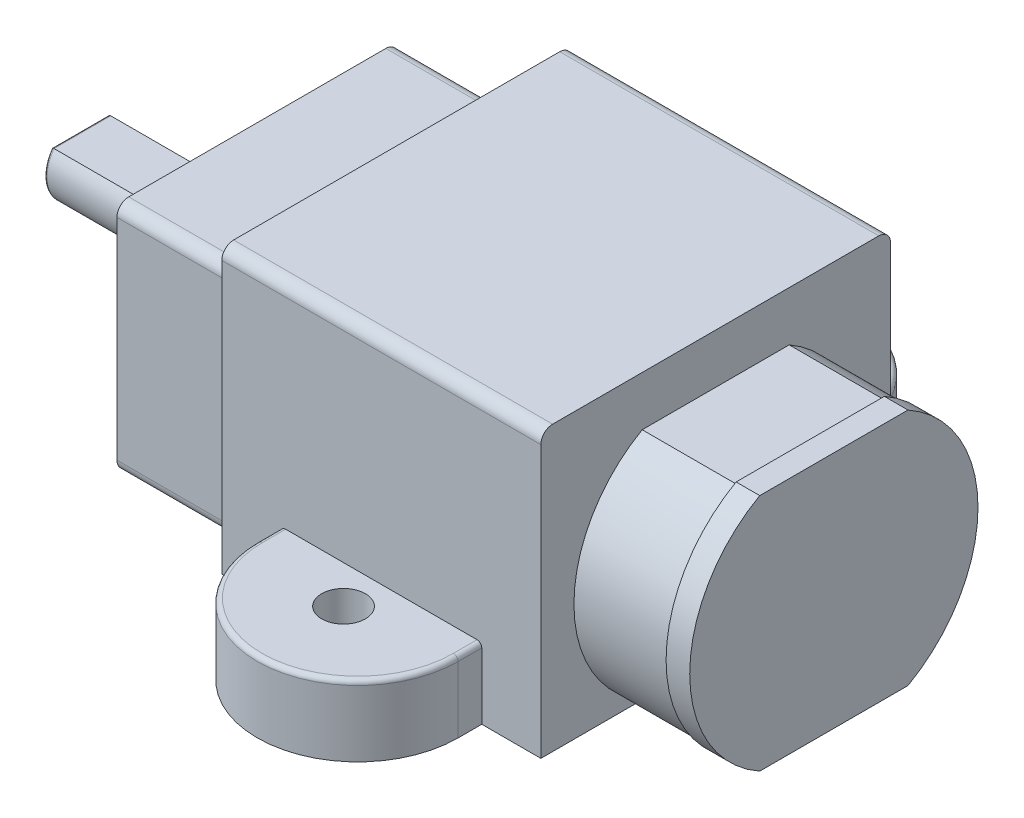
ISO-10303-21;
HEADER;
FILE_DESCRIPTION(('STEP AP214'),'2;1');
FILE_NAME('part.step','',(''),(''),'','','');
FILE_SCHEMA(('AUTOMOTIVE_DESIGN { 1 0 10303 214 1 1 1 1 }'));
ENDSEC;
DATA;
#1=APPLICATION_CONTEXT('core data for automotive mechanical design processes');
#2=APPLICATION_PROTOCOL_DEFINITION('international standard','automotive_design',2000,#1);
#3=PRODUCT_CONTEXT('',#1,'mechanical');
#4=PRODUCT('Part','Part','',(#3));
#5=PRODUCT_RELATED_PRODUCT_CATEGORY('part','',(#4));
#6=PRODUCT_DEFINITION_FORMATION('','',#4);
#7=PRODUCT_DEFINITION_CONTEXT('part definition',#1,'design');
#8=PRODUCT_DEFINITION('design','',#6,#7);
#9=PRODUCT_DEFINITION_SHAPE('','',#8);
#10=(LENGTH_UNIT() NAMED_UNIT(*) SI_UNIT(.MILLI.,.METRE.));
#11=(NAMED_UNIT(*) PLANE_ANGLE_UNIT() SI_UNIT($,.RADIAN.));
#12=(NAMED_UNIT(*) SI_UNIT($,.STERADIAN.) SOLID_ANGLE_UNIT());
#13=UNCERTAINTY_MEASURE_WITH_UNIT(LENGTH_MEASURE(1.E-05),#10,'distance_accuracy_value','');
#14=(GEOMETRIC_REPRESENTATION_CONTEXT(3) GLOBAL_UNCERTAINTY_ASSIGNED_CONTEXT((#13)) GLOBAL_UNIT_ASSIGNED_CONTEXT((#10,
#11,#12)) REPRESENTATION_CONTEXT('',''));
#15=CARTESIAN_POINT('',(0.,0.,0.));
#16=DIRECTION('',(0.,0.,1.));
#17=DIRECTION('',(1.,0.,0.));
#18=AXIS2_PLACEMENT_3D('',#15,#16,#17);
#19=CARTESIAN_POINT('',(13.5,12.,0.));
#20=DIRECTION('',(-1.,0.,0.));
#21=DIRECTION('',(0.,0.,1.));
#22=AXIS2_PLACEMENT_3D('',#19,#20,#21);
#23=PLANE('',#22);
#24=CARTESIAN_POINT('',(13.5,4.95,-7.0847886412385));
#25=DIRECTION('',(1.,0.,0.));
#26=DIRECTION('',(0.,0.,-1.));
#27=AXIS2_PLACEMENT_3D('',#24,#25,#26);
#28=CIRCLE('',#27,5.68478864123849);
#29=CARTESIAN_POINT('',(13.5,9.9,-4.28937777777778));
#30=VERTEX_POINT('',#29);
#31=CARTESIAN_POINT('',(13.5,0.,-4.28937777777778));
#32=VERTEX_POINT('',#31);
#33=EDGE_CURVE('E31',#30,#32,#28,.T.);
#34=ORIENTED_EDGE('',*,*,#33,.F.);
#35=DIRECTION('',(0.,0.,1.));
#36=VECTOR('',#35,1.);
#37=CARTESIAN_POINT('',(13.5,9.9,-4.28937777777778));
#38=LINE('',#37,#36);
#39=CARTESIAN_POINT('',(13.5,9.9,-10.5106222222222));
#40=VERTEX_POINT('',#39);
#41=EDGE_CURVE('E308',#40,#30,#38,.T.);
#42=ORIENTED_EDGE('',*,*,#41,.F.);
#43=CARTESIAN_POINT('',(13.5,4.95,-7.7152113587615));
#44=DIRECTION('',(1.,0.,0.));
#45=DIRECTION('',(0.,0.,1.));
#46=AXIS2_PLACEMENT_3D('',#43,#44,#45);
#47=CIRCLE('',#46,5.68478864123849);
#48=CARTESIAN_POINT('',(13.5,0.,-10.5106222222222));
#49=VERTEX_POINT('',#48);
#50=EDGE_CURVE('E50',#49,#40,#47,.T.);
#51=ORIENTED_EDGE('',*,*,#50,.F.);
#52=DIRECTION('',(0.,0.,-1.));
#53=VECTOR('',#52,1.);
#54=CARTESIAN_POINT('',(13.5,0.,0.));
#55=LINE('',#54,#53);
#56=CARTESIAN_POINT('',(13.5,0.,-14.8));
#57=VERTEX_POINT('',#56);
#58=EDGE_CURVE('E542',#49,#57,#55,.T.);
#59=ORIENTED_EDGE('',*,*,#58,.T.);
#60=DIRECTION('',(0.,-1.,0.));
#61=VECTOR('',#60,1.);
#62=CARTESIAN_POINT('',(13.5,12.,-14.8));
#63=LINE('',#62,#61);
#64=CARTESIAN_POINT('',(13.5,11.5,-14.8));
#65=VERTEX_POINT('',#64);
#66=EDGE_CURVE('E749',#65,#57,#63,.T.);
#67=ORIENTED_EDGE('',*,*,#66,.F.);
#68=CARTESIAN_POINT('',(13.5,11.5,-14.3));
#69=DIRECTION('',(-1.,0.,0.));
#70=DIRECTION('',(0.,0.,1.));
#71=AXIS2_PLACEMENT_3D('',#68,#69,#70);
#72=CIRCLE('',#71,0.5);
#73=CARTESIAN_POINT('',(13.5,12.,-14.3));
#74=VERTEX_POINT('',#73);
#75=EDGE_CURVE('E767',#65,#74,#72,.F.);
#76=ORIENTED_EDGE('',*,*,#75,.T.);
#77=DIRECTION('',(0.,0.,-1.));
#78=VECTOR('',#77,1.);
#79=CARTESIAN_POINT('',(13.5,12.,0.));
#80=LINE('',#79,#78);
#81=CARTESIAN_POINT('',(13.5,12.,-0.5));
#82=VERTEX_POINT('',#81);
#83=EDGE_CURVE('E739',#82,#74,#80,.T.);
#84=ORIENTED_EDGE('',*,*,#83,.F.);
#85=CARTESIAN_POINT('',(13.5,11.5,-0.5));
#86=DIRECTION('',(-1.,0.,0.));
#87=DIRECTION('',(0.,0.,1.));
#88=AXIS2_PLACEMENT_3D('',#85,#86,#87);
#89=CIRCLE('',#88,0.5);
#90=CARTESIAN_POINT('',(13.5,11.5,0.));
#91=VERTEX_POINT('',#90);
#92=EDGE_CURVE('E765',#82,#91,#89,.F.);
#93=ORIENTED_EDGE('',*,*,#92,.T.);
#94=DIRECTION('',(0.,-1.,0.));
#95=VECTOR('',#94,1.);
#96=CARTESIAN_POINT('',(13.5,12.,0.));
#97=LINE('',#96,#95);
#98=CARTESIAN_POINT('',(13.5,0.,0.));
#99=VERTEX_POINT('',#98);
#100=EDGE_CURVE('E751',#91,#99,#97,.T.);
#101=ORIENTED_EDGE('',*,*,#100,.T.);
#102=EDGE_CURVE('E551',#99,#32,#55,.T.);
#103=ORIENTED_EDGE('',*,*,#102,.T.);
#104=EDGE_LOOP('',(#34,#42,#51,#59,#67,#76,#84,#93,#101,#103));
#105=FACE_BOUND('',#104,.T.);
#106=ADVANCED_FACE('F27',(#105),#23,.F.);
#107=CARTESIAN_POINT('',(-6.4,4.95,-7.4));
#108=DIRECTION('',(-1.,0.,0.));
#109=DIRECTION('',(0.,0.,1.));
#110=AXIS2_PLACEMENT_3D('',#107,#108,#109);
#111=PLANE('',#110);
#112=CARTESIAN_POINT('',(-6.4,4.95,-7.4));
#113=DIRECTION('',(-1.,0.,0.));
#114=DIRECTION('',(0.,0.,1.));
#115=AXIS2_PLACEMENT_3D('',#112,#113,#114);
#116=CIRCLE('',#115,2.);
#117=CARTESIAN_POINT('',(-6.4,4.95,-5.4));
#118=VERTEX_POINT('',#117);
#119=EDGE_CURVE('E854',#118,#118,#116,.T.);
#120=ORIENTED_EDGE('',*,*,#119,.T.);
#121=EDGE_LOOP('',(#120));
#122=FACE_BOUND('',#121,.T.);
#123=CARTESIAN_POINT('',(-6.4,4.95,-7.4));
#124=DIRECTION('',(-1.,0.,0.));
#125=DIRECTION('',(0.,0.,1.));
#126=AXIS2_PLACEMENT_3D('',#123,#124,#125);
#127=CIRCLE('',#126,1.5);
#128=CARTESIAN_POINT('',(-6.4,4.95,-5.9));
#129=VERTEX_POINT('',#128);
#130=EDGE_CURVE('E856',#129,#129,#127,.T.);
#131=ORIENTED_EDGE('',*,*,#130,.F.);
#132=EDGE_LOOP('',(#131));
#133=FACE_BOUND('',#132,.T.);
#134=ADVANCED_FACE('F368',(#122,#133),#111,.T.);
#135=CARTESIAN_POINT('',(-5.9,9.4,-12.84));
#136=DIRECTION('',(-1.,0.,0.));
#137=DIRECTION('',(0.,0.,1.));
#138=AXIS2_PLACEMENT_3D('',#135,#136,#137);
#139=PLANE('',#138);
#140=CARTESIAN_POINT('',(-5.9,9.4,-12.84));
#141=DIRECTION('',(-1.,0.,0.));
#142=DIRECTION('',(0.,0.,1.));
#143=AXIS2_PLACEMENT_3D('',#140,#141,#142);
#144=CIRCLE('',#143,0.5);
#145=CARTESIAN_POINT('',(-5.9,9.9,-12.84));
#146=VERTEX_POINT('',#145);
#147=CARTESIAN_POINT('',(-5.9,9.4,-13.34));
#148=VERTEX_POINT('',#147);
#149=EDGE_CURVE('E591',#146,#148,#144,.T.);
#150=ORIENTED_EDGE('',*,*,#149,.T.);
#151=DIRECTION('',(0.,-1.,0.));
#152=VECTOR('',#151,1.);
#153=CARTESIAN_POINT('',(-5.9,9.4,-13.34));
#154=LINE('',#153,#152);
#155=CARTESIAN_POINT('',(-5.9,0.500000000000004,-13.34));
#156=VERTEX_POINT('',#155);
#157=EDGE_CURVE('E594',#148,#156,#154,.T.);
#158=ORIENTED_EDGE('',*,*,#157,.T.);
#159=CARTESIAN_POINT('',(-5.9,0.5,-12.84));
#160=DIRECTION('',(-1.,0.,0.));
#161=DIRECTION('',(0.,0.,-1.));
#162=AXIS2_PLACEMENT_3D('',#159,#160,#161);
#163=CIRCLE('',#162,0.5);
#164=CARTESIAN_POINT('',(-5.9,0.,-12.84));
#165=VERTEX_POINT('',#164);
#166=EDGE_CURVE('E596',#156,#165,#163,.T.);
#167=ORIENTED_EDGE('',*,*,#166,.T.);
#168=DIRECTION('',(0.,0.,1.));
#169=VECTOR('',#168,1.);
#170=CARTESIAN_POINT('',(-5.9,0.,-12.84));
#171=LINE('',#170,#169);
#172=CARTESIAN_POINT('',(-5.9,0.,-1.96));
#173=VERTEX_POINT('',#172);
#174=EDGE_CURVE('E598',#165,#173,#171,.T.);
#175=ORIENTED_EDGE('',*,*,#174,.T.);
#176=CARTESIAN_POINT('',(-5.9,0.500000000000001,-1.96));
#177=DIRECTION('',(-1.,0.,0.));
#178=DIRECTION('',(0.,0.,1.));
#179=AXIS2_PLACEMENT_3D('',#176,#177,#178);
#180=CIRCLE('',#179,0.5);
#181=CARTESIAN_POINT('',(-5.9,0.500000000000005,-1.46));
#182=VERTEX_POINT('',#181);
#183=EDGE_CURVE('E600',#173,#182,#180,.T.);
#184=ORIENTED_EDGE('',*,*,#183,.T.);
#185=DIRECTION('',(0.,1.,0.));
#186=VECTOR('',#185,1.);
#187=CARTESIAN_POINT('',(-5.9,9.4,-1.46));
#188=LINE('',#187,#186);
#189=CARTESIAN_POINT('',(-5.9,9.4,-1.46));
#190=VERTEX_POINT('',#189);
#191=EDGE_CURVE('E602',#182,#190,#188,.T.);
#192=ORIENTED_EDGE('',*,*,#191,.T.);
#193=CARTESIAN_POINT('',(-5.9,9.4,-1.96));
#194=DIRECTION('',(-1.,0.,0.));
#195=DIRECTION('',(0.,0.,1.));
#196=AXIS2_PLACEMENT_3D('',#193,#194,#195);
#197=CIRCLE('',#196,0.5);
#198=CARTESIAN_POINT('',(-5.9,9.9,-1.96));
#199=VERTEX_POINT('',#198);
#200=EDGE_CURVE('E604',#190,#199,#197,.T.);
#201=ORIENTED_EDGE('',*,*,#200,.T.);
#202=DIRECTION('',(0.,0.,-1.));
#203=VECTOR('',#202,1.);
#204=CARTESIAN_POINT('',(-5.9,9.9,-12.84));
#205=LINE('',#204,#203);
#206=EDGE_CURVE('E606',#199,#146,#205,.T.);
#207=ORIENTED_EDGE('',*,*,#206,.T.);
#208=EDGE_LOOP('',(#150,#158,#167,#175,#184,#192,#201,#207));
#209=FACE_BOUND('',#208,.T.);
#210=CARTESIAN_POINT('',(-5.9,4.95,-7.4));
#211=DIRECTION('',(-1.,0.,0.));
#212=DIRECTION('',(0.,0.,1.));
#213=AXIS2_PLACEMENT_3D('',#210,#211,#212);
#214=CIRCLE('',#213,2.);
#215=CARTESIAN_POINT('',(-5.9,4.95,-5.4));
#216=VERTEX_POINT('',#215);
#217=EDGE_CURVE('E851',#216,#216,#214,.T.);
#218=ORIENTED_EDGE('',*,*,#217,.F.);
#219=EDGE_LOOP('',(#218));
#220=FACE_BOUND('',#219,.T.);
#221=ADVANCED_FACE('F371',(#209,#220),#139,.T.);
#222=CARTESIAN_POINT('',(0.,12.,0.));
#223=DIRECTION('',(1.,0.,0.));
#224=DIRECTION('',(0.,0.,-1.));
#225=AXIS2_PLACEMENT_3D('',#222,#223,#224);
#226=PLANE('',#225);
#227=CARTESIAN_POINT('',(0.,0.500000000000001,-1.96));
#228=DIRECTION('',(-1.,0.,0.));
#229=DIRECTION('',(0.,0.,1.));
#230=AXIS2_PLACEMENT_3D('',#227,#228,#229);
#231=CIRCLE('',#230,0.5);
#232=CARTESIAN_POINT('',(0.,0.,-1.96));
#233=VERTEX_POINT('',#232);
#234=CARTESIAN_POINT('',(0.,0.500000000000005,-1.46));
#235=VERTEX_POINT('',#234);
#236=EDGE_CURVE('E574',#233,#235,#231,.T.);
#237=ORIENTED_EDGE('',*,*,#236,.F.);
#238=DIRECTION('',(0.,0.,1.));
#239=VECTOR('',#238,1.);
#240=CARTESIAN_POINT('',(0.,0.,0.));
#241=LINE('',#240,#239);
#242=CARTESIAN_POINT('',(0.,0.,0.));
#243=VERTEX_POINT('',#242);
#244=EDGE_CURVE('E535',#233,#243,#241,.T.);
#245=ORIENTED_EDGE('',*,*,#244,.T.);
#246=DIRECTION('',(0.,-1.,0.));
#247=VECTOR('',#246,1.);
#248=CARTESIAN_POINT('',(0.,12.,0.));
#249=LINE('',#248,#247);
#250=CARTESIAN_POINT('',(0.,11.5,0.));
#251=VERTEX_POINT('',#250);
#252=EDGE_CURVE('E753',#251,#243,#249,.T.);
#253=ORIENTED_EDGE('',*,*,#252,.F.);
#254=CARTESIAN_POINT('',(0.,11.5,-0.5));
#255=DIRECTION('',(1.,0.,0.));
#256=DIRECTION('',(0.,0.,-1.));
#257=AXIS2_PLACEMENT_3D('',#254,#255,#256);
#258=CIRCLE('',#257,0.5);
#259=CARTESIAN_POINT('',(0.,12.,-0.5));
#260=VERTEX_POINT('',#259);
#261=EDGE_CURVE('E759',#251,#260,#258,.F.);
#262=ORIENTED_EDGE('',*,*,#261,.T.);
#263=DIRECTION('',(0.,0.,1.));
#264=VECTOR('',#263,1.);
#265=CARTESIAN_POINT('',(0.,12.,0.));
#266=LINE('',#265,#264);
#267=CARTESIAN_POINT('',(0.,12.,-14.3));
#268=VERTEX_POINT('',#267);
#269=EDGE_CURVE('E735',#268,#260,#266,.T.);
#270=ORIENTED_EDGE('',*,*,#269,.F.);
#271=CARTESIAN_POINT('',(0.,11.5,-14.3));
#272=DIRECTION('',(1.,0.,0.));
#273=DIRECTION('',(0.,0.,-1.));
#274=AXIS2_PLACEMENT_3D('',#271,#272,#273);
#275=CIRCLE('',#274,0.5);
#276=CARTESIAN_POINT('',(0.,11.5,-14.8));
#277=VERTEX_POINT('',#276);
#278=EDGE_CURVE('E761',#268,#277,#275,.F.);
#279=ORIENTED_EDGE('',*,*,#278,.T.);
#280=DIRECTION('',(0.,-1.,0.));
#281=VECTOR('',#280,1.);
#282=CARTESIAN_POINT('',(0.,12.,-14.8));
#283=LINE('',#282,#281);
#284=CARTESIAN_POINT('',(0.,0.,-14.8));
#285=VERTEX_POINT('',#284);
#286=EDGE_CURVE('E745',#277,#285,#283,.T.);
#287=ORIENTED_EDGE('',*,*,#286,.T.);
#288=CARTESIAN_POINT('',(0.,0.,-12.84));
#289=VERTEX_POINT('',#288);
#290=EDGE_CURVE('E531',#285,#289,#241,.T.);
#291=ORIENTED_EDGE('',*,*,#290,.T.);
#292=CARTESIAN_POINT('',(0.,0.5,-12.84));
#293=DIRECTION('',(-1.,0.,0.));
#294=DIRECTION('',(0.,0.,-1.));
#295=AXIS2_PLACEMENT_3D('',#292,#293,#294);
#296=CIRCLE('',#295,0.5);
#297=CARTESIAN_POINT('',(0.,0.500000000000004,-13.34));
#298=VERTEX_POINT('',#297);
#299=EDGE_CURVE('E570',#298,#289,#296,.T.);
#300=ORIENTED_EDGE('',*,*,#299,.F.);
#301=DIRECTION('',(0.,-1.,0.));
#302=VECTOR('',#301,1.);
#303=CARTESIAN_POINT('',(0.,9.4,-13.34));
#304=LINE('',#303,#302);
#305=CARTESIAN_POINT('',(0.,9.4,-13.34));
#306=VERTEX_POINT('',#305);
#307=EDGE_CURVE('E575',#306,#298,#304,.T.);
#308=ORIENTED_EDGE('',*,*,#307,.F.);
#309=CARTESIAN_POINT('',(0.,9.4,-12.84));
#310=DIRECTION('',(-1.,0.,0.));
#311=DIRECTION('',(0.,0.,1.));
#312=AXIS2_PLACEMENT_3D('',#309,#310,#311);
#313=CIRCLE('',#312,0.5);
#314=CARTESIAN_POINT('',(0.,9.9,-12.84));
#315=VERTEX_POINT('',#314);
#316=EDGE_CURVE('E861',#315,#306,#313,.T.);
#317=ORIENTED_EDGE('',*,*,#316,.F.);
#318=DIRECTION('',(0.,0.,-1.));
#319=VECTOR('',#318,1.);
#320=CARTESIAN_POINT('',(0.,9.9,-12.84));
#321=LINE('',#320,#319);
#322=CARTESIAN_POINT('',(0.,9.9,-1.96));
#323=VERTEX_POINT('',#322);
#324=EDGE_CURVE('E588',#323,#315,#321,.T.);
#325=ORIENTED_EDGE('',*,*,#324,.F.);
#326=CARTESIAN_POINT('',(0.,9.4,-1.96));
#327=DIRECTION('',(-1.,0.,0.));
#328=DIRECTION('',(0.,0.,1.));
#329=AXIS2_PLACEMENT_3D('',#326,#327,#328);
#330=CIRCLE('',#329,0.5);
#331=CARTESIAN_POINT('',(0.,9.4,-1.46));
#332=VERTEX_POINT('',#331);
#333=EDGE_CURVE('E585',#332,#323,#330,.T.);
#334=ORIENTED_EDGE('',*,*,#333,.F.);
#335=DIRECTION('',(0.,1.,0.));
#336=VECTOR('',#335,1.);
#337=CARTESIAN_POINT('',(0.,9.4,-1.46));
#338=LINE('',#337,#336);
#339=EDGE_CURVE('E582',#235,#332,#338,.T.);
#340=ORIENTED_EDGE('',*,*,#339,.F.);
#341=EDGE_LOOP('',(#237,#245,#253,#262,#270,#279,#287,#291,#300,#308,#317,#325,#334,#340));
#342=FACE_BOUND('',#341,.T.);
#343=ADVANCED_FACE('F29',(#342),#226,.F.);
#344=CARTESIAN_POINT('',(0.,12.,0.));
#345=DIRECTION('',(0.,0.,-1.));
#346=DIRECTION('',(-1.,0.,0.));
#347=AXIS2_PLACEMENT_3D('',#344,#345,#346);
#348=PLANE('',#347);
#349=DIRECTION('',(0.,-1.,0.));
#350=VECTOR('',#349,1.);
#351=CARTESIAN_POINT('',(2.5,3.,0.));
#352=LINE('',#351,#350);
#353=CARTESIAN_POINT('',(2.5,2.8,0.));
#354=VERTEX_POINT('',#353);
#355=CARTESIAN_POINT('',(2.5,0.,0.));
#356=VERTEX_POINT('',#355);
#357=EDGE_CURVE('E501',#354,#356,#352,.T.);
#358=ORIENTED_EDGE('',*,*,#357,.F.);
#359=CARTESIAN_POINT('',(2.7,2.8,0.));
#360=DIRECTION('',(0.,0.,-1.));
#361=DIRECTION('',(-1.,0.,0.));
#362=AXIS2_PLACEMENT_3D('',#359,#360,#361);
#363=CIRCLE('',#362,0.2);
#364=CARTESIAN_POINT('',(2.7,3.,0.));
#365=VERTEX_POINT('',#364);
#366=EDGE_CURVE('E504',#354,#365,#363,.T.);
#367=ORIENTED_EDGE('',*,*,#366,.T.);
#368=DIRECTION('',(1.,0.,0.));
#369=VECTOR('',#368,1.);
#370=CARTESIAN_POINT('',(2.5,3.,0.));
#371=LINE('',#370,#369);
#372=CARTESIAN_POINT('',(10.8,3.,0.));
#373=VERTEX_POINT('',#372);
#374=EDGE_CURVE('E674',#365,#373,#371,.T.);
#375=ORIENTED_EDGE('',*,*,#374,.T.);
#376=CARTESIAN_POINT('',(10.8,2.8,0.));
#377=DIRECTION('',(0.,0.,-1.));
#378=DIRECTION('',(-1.,0.,0.));
#379=AXIS2_PLACEMENT_3D('',#376,#377,#378);
#380=CIRCLE('',#379,0.2);
#381=CARTESIAN_POINT('',(11.,2.8,0.));
#382=VERTEX_POINT('',#381);
#383=EDGE_CURVE('E521',#373,#382,#380,.T.);
#384=ORIENTED_EDGE('',*,*,#383,.T.);
#385=DIRECTION('',(0.,-1.,0.));
#386=VECTOR('',#385,1.);
#387=CARTESIAN_POINT('',(11.,3.,0.));
#388=LINE('',#387,#386);
#389=CARTESIAN_POINT('',(11.,0.,0.));
#390=VERTEX_POINT('',#389);
#391=EDGE_CURVE('E511',#382,#390,#388,.T.);
#392=ORIENTED_EDGE('',*,*,#391,.T.);
#393=DIRECTION('',(1.,0.,0.));
#394=VECTOR('',#393,1.);
#395=CARTESIAN_POINT('',(0.,0.,0.));
#396=LINE('',#395,#394);
#397=EDGE_CURVE('E534',#390,#99,#396,.T.);
#398=ORIENTED_EDGE('',*,*,#397,.T.);
#399=ORIENTED_EDGE('',*,*,#100,.F.);
#400=DIRECTION('',(1.,0.,0.));
#401=VECTOR('',#400,1.);
#402=CARTESIAN_POINT('',(0.,11.5,0.));
#403=LINE('',#402,#401);
#404=EDGE_CURVE('E769',#91,#251,#403,.F.);
#405=ORIENTED_EDGE('',*,*,#404,.T.);
#406=ORIENTED_EDGE('',*,*,#252,.T.);
#407=EDGE_CURVE('E508',#243,#356,#396,.T.);
#408=ORIENTED_EDGE('',*,*,#407,.T.);
#409=EDGE_LOOP('',(#358,#367,#375,#384,#392,#398,#399,#405,#406,#408));
#410=FACE_BOUND('',#409,.T.);
#411=ADVANCED_FACE('F490',(#410),#348,.F.);
#412=CARTESIAN_POINT('',(0.,12.,-14.8));
#413=DIRECTION('',(0.,0.,1.));
#414=DIRECTION('',(1.,0.,0.));
#415=AXIS2_PLACEMENT_3D('',#412,#413,#414);
#416=PLANE('',#415);
#417=DIRECTION('',(0.,-1.,0.));
#418=VECTOR('',#417,1.);
#419=CARTESIAN_POINT('',(11.,3.,-14.8));
#420=LINE('',#419,#418);
#421=CARTESIAN_POINT('',(11.,2.8,-14.8));
#422=VERTEX_POINT('',#421);
#423=CARTESIAN_POINT('',(11.,0.,-14.8));
#424=VERTEX_POINT('',#423);
#425=EDGE_CURVE('E658',#422,#424,#420,.T.);
#426=ORIENTED_EDGE('',*,*,#425,.F.);
#427=CARTESIAN_POINT('',(10.8,2.8,-14.8));
#428=DIRECTION('',(0.,0.,1.));
#429=DIRECTION('',(1.,0.,0.));
#430=AXIS2_PLACEMENT_3D('',#427,#428,#429);
#431=CIRCLE('',#430,0.2);
#432=CARTESIAN_POINT('',(10.8,3.,-14.8));
#433=VERTEX_POINT('',#432);
#434=EDGE_CURVE('E523',#422,#433,#431,.T.);
#435=ORIENTED_EDGE('',*,*,#434,.T.);
#436=DIRECTION('',(-1.,0.,0.));
#437=VECTOR('',#436,1.);
#438=CARTESIAN_POINT('',(2.5,3.,-14.8));
#439=LINE('',#438,#437);
#440=CARTESIAN_POINT('',(2.7,3.,-14.8));
#441=VERTEX_POINT('',#440);
#442=EDGE_CURVE('E649',#433,#441,#439,.T.);
#443=ORIENTED_EDGE('',*,*,#442,.T.);
#444=CARTESIAN_POINT('',(2.7,2.8,-14.8));
#445=DIRECTION('',(0.,0.,1.));
#446=DIRECTION('',(1.,0.,0.));
#447=AXIS2_PLACEMENT_3D('',#444,#445,#446);
#448=CIRCLE('',#447,0.2);
#449=CARTESIAN_POINT('',(2.5,2.8,-14.8));
#450=VERTEX_POINT('',#449);
#451=EDGE_CURVE('E520',#441,#450,#448,.T.);
#452=ORIENTED_EDGE('',*,*,#451,.T.);
#453=DIRECTION('',(0.,-1.,0.));
#454=VECTOR('',#453,1.);
#455=CARTESIAN_POINT('',(2.5,3.,-14.8));
#456=LINE('',#455,#454);
#457=CARTESIAN_POINT('',(2.5,0.,-14.8));
#458=VERTEX_POINT('',#457);
#459=EDGE_CURVE('E656',#450,#458,#456,.T.);
#460=ORIENTED_EDGE('',*,*,#459,.T.);
#461=DIRECTION('',(-1.,0.,0.));
#462=VECTOR('',#461,1.);
#463=CARTESIAN_POINT('',(0.,0.,-14.8));
#464=LINE('',#463,#462);
#465=EDGE_CURVE('E552',#458,#285,#464,.T.);
#466=ORIENTED_EDGE('',*,*,#465,.T.);
#467=ORIENTED_EDGE('',*,*,#286,.F.);
#468=DIRECTION('',(-1.,0.,0.));
#469=VECTOR('',#468,1.);
#470=CARTESIAN_POINT('',(0.,11.5,-14.8));
#471=LINE('',#470,#469);
#472=EDGE_CURVE('E763',#277,#65,#471,.F.);
#473=ORIENTED_EDGE('',*,*,#472,.T.);
#474=ORIENTED_EDGE('',*,*,#66,.T.);
#475=EDGE_CURVE('E545',#57,#424,#464,.T.);
#476=ORIENTED_EDGE('',*,*,#475,.T.);
#477=EDGE_LOOP('',(#426,#435,#443,#452,#460,#466,#467,#473,#474,#476));
#478=FACE_BOUND('',#477,.T.);
#479=ADVANCED_FACE('F486',(#478),#416,.F.);
#480=CARTESIAN_POINT('',(0.,12.,-14.8));
#481=DIRECTION('',(0.,-1.,0.));
#482=DIRECTION('',(0.,0.,-1.));
#483=AXIS2_PLACEMENT_3D('',#480,#481,#482);
#484=PLANE('',#483);
#485=ORIENTED_EDGE('',*,*,#83,.T.);
#486=DIRECTION('',(-1.,0.,0.));
#487=VECTOR('',#486,1.);
#488=CARTESIAN_POINT('',(0.,12.,-14.3));
#489=LINE('',#488,#487);
#490=EDGE_CURVE('E757',#74,#268,#489,.T.);
#491=ORIENTED_EDGE('',*,*,#490,.T.);
#492=ORIENTED_EDGE('',*,*,#269,.T.);
#493=DIRECTION('',(1.,0.,0.));
#494=VECTOR('',#493,1.);
#495=CARTESIAN_POINT('',(0.,12.,-0.5));
#496=LINE('',#495,#494);
#497=EDGE_CURVE('E755',#260,#82,#496,.T.);
#498=ORIENTED_EDGE('',*,*,#497,.T.);
#499=EDGE_LOOP('',(#485,#491,#492,#498));
#500=FACE_BOUND('',#499,.T.);
#501=ADVANCED_FACE('F482',(#500),#484,.F.);
#502=CARTESIAN_POINT('',(0.,0.,-14.8));
#503=DIRECTION('',(0.,-1.,0.));
#504=DIRECTION('',(0.,0.,-1.));
#505=AXIS2_PLACEMENT_3D('',#502,#503,#504);
#506=PLANE('',#505);
#507=ORIENTED_EDGE('',*,*,#290,.F.);
#508=ORIENTED_EDGE('',*,*,#465,.F.);
#509=DIRECTION('',(0.,0.,-1.));
#510=VECTOR('',#509,1.);
#511=CARTESIAN_POINT('',(2.5,0.,-14.8));
#512=LINE('',#511,#510);
#513=CARTESIAN_POINT('',(2.5,0.,-15.8));
#514=VERTEX_POINT('',#513);
#515=EDGE_CURVE('E646',#458,#514,#512,.T.);
#516=ORIENTED_EDGE('',*,*,#515,.T.);
#517=CARTESIAN_POINT('',(6.75,0.,-15.8));
#518=DIRECTION('',(0.,-1.,0.));
#519=DIRECTION('',(0.,0.,-1.));
#520=AXIS2_PLACEMENT_3D('',#517,#518,#519);
#521=CIRCLE('',#520,4.25);
#522=CARTESIAN_POINT('',(11.,0.,-15.8));
#523=VERTEX_POINT('',#522);
#524=EDGE_CURVE('E640',#514,#523,#521,.T.);
#525=ORIENTED_EDGE('',*,*,#524,.T.);
#526=DIRECTION('',(0.,0.,1.));
#527=VECTOR('',#526,1.);
#528=CARTESIAN_POINT('',(11.,0.,-14.8));
#529=LINE('',#528,#527);
#530=EDGE_CURVE('E643',#523,#424,#529,.T.);
#531=ORIENTED_EDGE('',*,*,#530,.T.);
#532=ORIENTED_EDGE('',*,*,#475,.F.);
#533=ORIENTED_EDGE('',*,*,#58,.F.);
#534=DIRECTION('',(-1.,0.,0.));
#535=VECTOR('',#534,1.);
#536=CARTESIAN_POINT('',(17.5,0.,-10.5106222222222));
#537=LINE('',#536,#535);
#538=CARTESIAN_POINT('',(17.5,0.,-10.5106222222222));
#539=VERTEX_POINT('',#538);
#540=EDGE_CURVE('E328',#539,#49,#537,.T.);
#541=ORIENTED_EDGE('',*,*,#540,.F.);
#542=DIRECTION('',(0.,0.,-1.));
#543=VECTOR('',#542,1.);
#544=CARTESIAN_POINT('',(17.5,0.,-4.28937777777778));
#545=LINE('',#544,#543);
#546=CARTESIAN_POINT('',(17.5,0.,-4.28937777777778));
#547=VERTEX_POINT('',#546);
#548=EDGE_CURVE('E313',#547,#539,#545,.T.);
#549=ORIENTED_EDGE('',*,*,#548,.F.);
#550=DIRECTION('',(-1.,0.,0.));
#551=VECTOR('',#550,1.);
#552=CARTESIAN_POINT('',(17.5,0.,-4.28937777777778));
#553=LINE('',#552,#551);
#554=EDGE_CURVE('E337',#547,#32,#553,.T.);
#555=ORIENTED_EDGE('',*,*,#554,.T.);
#556=ORIENTED_EDGE('',*,*,#102,.F.);
#557=ORIENTED_EDGE('',*,*,#397,.F.);
#558=DIRECTION('',(0.,0.,1.));
#559=VECTOR('',#558,1.);
#560=CARTESIAN_POINT('',(11.,0.,0.));
#561=LINE('',#560,#559);
#562=CARTESIAN_POINT('',(11.,0.,1.));
#563=VERTEX_POINT('',#562);
#564=EDGE_CURVE('E671',#390,#563,#561,.T.);
#565=ORIENTED_EDGE('',*,*,#564,.T.);
#566=CARTESIAN_POINT('',(6.75,0.,1.));
#567=DIRECTION('',(0.,-1.,0.));
#568=DIRECTION('',(0.,0.,1.));
#569=AXIS2_PLACEMENT_3D('',#566,#567,#568);
#570=CIRCLE('',#569,4.25);
#571=CARTESIAN_POINT('',(2.5,0.,1.));
#572=VERTEX_POINT('',#571);
#573=EDGE_CURVE('E666',#563,#572,#570,.T.);
#574=ORIENTED_EDGE('',*,*,#573,.T.);
#575=DIRECTION('',(0.,0.,-1.));
#576=VECTOR('',#575,1.);
#577=CARTESIAN_POINT('',(2.5,0.,0.));
#578=LINE('',#577,#576);
#579=EDGE_CURVE('E669',#572,#356,#578,.T.);
#580=ORIENTED_EDGE('',*,*,#579,.T.);
#581=ORIENTED_EDGE('',*,*,#407,.F.);
#582=ORIENTED_EDGE('',*,*,#244,.F.);
#583=DIRECTION('',(1.,0.,0.));
#584=VECTOR('',#583,1.);
#585=CARTESIAN_POINT('',(-5.9,0.,-1.96));
#586=LINE('',#585,#584);
#587=EDGE_CURVE('E569',#173,#233,#586,.T.);
#588=ORIENTED_EDGE('',*,*,#587,.F.);
#589=ORIENTED_EDGE('',*,*,#174,.F.);
#590=DIRECTION('',(1.,0.,0.));
#591=VECTOR('',#590,1.);
#592=CARTESIAN_POINT('',(-5.9,0.,-12.84));
#593=LINE('',#592,#591);
#594=EDGE_CURVE('E565',#165,#289,#593,.T.);
#595=ORIENTED_EDGE('',*,*,#594,.T.);
#596=EDGE_LOOP('',(#507,#508,#516,#525,#531,#532,#533,#541,#549,#555,#556,#557,#565,#574,#580,
#581,#582,#588,#589,#595));
#597=FACE_BOUND('',#596,.T.);
#598=CARTESIAN_POINT('',(6.75,0.,1.6));
#599=DIRECTION('',(0.,-1.,0.));
#600=DIRECTION('',(0.,0.,-1.));
#601=AXIS2_PLACEMENT_3D('',#598,#599,#600);
#602=CIRCLE('',#601,0.925000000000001);
#603=CARTESIAN_POINT('',(6.75,0.,0.675000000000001));
#604=VERTEX_POINT('',#603);
#605=EDGE_CURVE('E655',#604,#604,#602,.T.);
#606=ORIENTED_EDGE('',*,*,#605,.F.);
#607=EDGE_LOOP('',(#606));
#608=FACE_BOUND('',#607,.T.);
#609=CARTESIAN_POINT('',(6.75,0.,-16.4));
#610=DIRECTION('',(0.,-1.,0.));
#611=DIRECTION('',(0.,0.,1.));
#612=AXIS2_PLACEMENT_3D('',#609,#610,#611);
#613=CIRCLE('',#612,0.925);
#614=CARTESIAN_POINT('',(6.75,0.,-15.475));
#615=VERTEX_POINT('',#614);
#616=EDGE_CURVE('E634',#615,#615,#613,.T.);
#617=ORIENTED_EDGE('',*,*,#616,.F.);
#618=EDGE_LOOP('',(#617));
#619=FACE_BOUND('',#618,.T.);
#620=ADVANCED_FACE('F478',(#597,#608,#619),#506,.T.);
#621=CARTESIAN_POINT('',(0.,11.5,-14.3));
#622=DIRECTION('',(-1.,0.,0.));
#623=DIRECTION('',(0.,0.,1.));
#624=AXIS2_PLACEMENT_3D('',#621,#622,#623);
#625=CYLINDRICAL_SURFACE('',#624,0.5);
#626=ORIENTED_EDGE('',*,*,#75,.F.);
#627=ORIENTED_EDGE('',*,*,#472,.F.);
#628=ORIENTED_EDGE('',*,*,#278,.F.);
#629=ORIENTED_EDGE('',*,*,#490,.F.);
#630=EDGE_LOOP('',(#626,#627,#628,#629));
#631=FACE_BOUND('',#630,.T.);
#632=ADVANCED_FACE('F474',(#631),#625,.T.);
#633=CARTESIAN_POINT('',(0.,11.5,-0.5));
#634=DIRECTION('',(1.,0.,0.));
#635=DIRECTION('',(0.,0.,-1.));
#636=AXIS2_PLACEMENT_3D('',#633,#634,#635);
#637=CYLINDRICAL_SURFACE('',#636,0.5);
#638=ORIENTED_EDGE('',*,*,#261,.F.);
#639=ORIENTED_EDGE('',*,*,#404,.F.);
#640=ORIENTED_EDGE('',*,*,#92,.F.);
#641=ORIENTED_EDGE('',*,*,#497,.F.);
#642=EDGE_LOOP('',(#638,#639,#640,#641));
#643=FACE_BOUND('',#642,.T.);
#644=ADVANCED_FACE('F470',(#643),#637,.T.);
#645=CARTESIAN_POINT('',(6.75,3.,1.));
#646=DIRECTION('',(0.,-1.,0.));
#647=DIRECTION('',(0.,0.,-1.));
#648=AXIS2_PLACEMENT_3D('',#645,#646,#647);
#649=CYLINDRICAL_SURFACE('',#648,4.25);
#650=DIRECTION('',(0.,-1.,0.));
#651=VECTOR('',#650,1.);
#652=CARTESIAN_POINT('',(11.,3.,1.));
#653=LINE('',#652,#651);
#654=CARTESIAN_POINT('',(11.,2.8,1.));
#655=VERTEX_POINT('',#654);
#656=EDGE_CURVE('E676',#655,#563,#653,.T.);
#657=ORIENTED_EDGE('',*,*,#656,.F.);
#658=CARTESIAN_POINT('',(6.75,2.8,1.));
#659=DIRECTION('',(0.,1.,0.));
#660=DIRECTION('',(0.,0.,1.));
#661=AXIS2_PLACEMENT_3D('',#658,#659,#660);
#662=CIRCLE('',#661,4.25);
#663=CARTESIAN_POINT('',(2.5,2.8,1.));
#664=VERTEX_POINT('',#663);
#665=EDGE_CURVE('E711',#655,#664,#662,.F.);
#666=ORIENTED_EDGE('',*,*,#665,.T.);
#667=DIRECTION('',(0.,-1.,0.));
#668=VECTOR('',#667,1.);
#669=CARTESIAN_POINT('',(2.5,3.,1.));
#670=LINE('',#669,#668);
#671=EDGE_CURVE('E512',#664,#572,#670,.T.);
#672=ORIENTED_EDGE('',*,*,#671,.T.);
#673=ORIENTED_EDGE('',*,*,#573,.F.);
#674=EDGE_LOOP('',(#657,#666,#672,#673));
#675=FACE_BOUND('',#674,.T.);
#676=ADVANCED_FACE('F463',(#675),#649,.T.);
#677=CARTESIAN_POINT('',(11.,3.,0.));
#678=DIRECTION('',(1.,0.,0.));
#679=DIRECTION('',(0.,0.,-1.));
#680=AXIS2_PLACEMENT_3D('',#677,#678,#679);
#681=PLANE('',#680);
#682=ORIENTED_EDGE('',*,*,#391,.F.);
#683=DIRECTION('',(0.,0.,1.));
#684=VECTOR('',#683,1.);
#685=CARTESIAN_POINT('',(11.,2.8,0.));
#686=LINE('',#685,#684);
#687=EDGE_CURVE('E692',#382,#655,#686,.T.);
#688=ORIENTED_EDGE('',*,*,#687,.T.);
#689=ORIENTED_EDGE('',*,*,#656,.T.);
#690=ORIENTED_EDGE('',*,*,#564,.F.);
#691=EDGE_LOOP('',(#682,#688,#689,#690));
#692=FACE_BOUND('',#691,.T.);
#693=ADVANCED_FACE('F460',(#692),#681,.T.);
#694=CARTESIAN_POINT('',(2.5,3.,0.));
#695=DIRECTION('',(-1.,0.,0.));
#696=DIRECTION('',(0.,0.,1.));
#697=AXIS2_PLACEMENT_3D('',#694,#695,#696);
#698=PLANE('',#697);
#699=ORIENTED_EDGE('',*,*,#671,.F.);
#700=DIRECTION('',(0.,0.,-1.));
#701=VECTOR('',#700,1.);
#702=CARTESIAN_POINT('',(2.5,2.8,0.));
#703=LINE('',#702,#701);
#704=EDGE_CURVE('E517',#664,#354,#703,.T.);
#705=ORIENTED_EDGE('',*,*,#704,.T.);
#706=ORIENTED_EDGE('',*,*,#357,.T.);
#707=ORIENTED_EDGE('',*,*,#579,.F.);
#708=EDGE_LOOP('',(#699,#705,#706,#707));
#709=FACE_BOUND('',#708,.T.);
#710=ADVANCED_FACE('F458',(#709),#698,.T.);
#711=CARTESIAN_POINT('',(6.75,3.,1.));
#712=DIRECTION('',(0.,1.,0.));
#713=DIRECTION('',(0.,0.,1.));
#714=AXIS2_PLACEMENT_3D('',#711,#712,#713);
#715=PLANE('',#714);
#716=CARTESIAN_POINT('',(6.75,3.,1.6));
#717=DIRECTION('',(0.,-1.,0.));
#718=DIRECTION('',(0.,0.,-1.));
#719=AXIS2_PLACEMENT_3D('',#716,#717,#718);
#720=CIRCLE('',#719,0.925000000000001);
#721=CARTESIAN_POINT('',(6.75,3.,0.675000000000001));
#722=VERTEX_POINT('',#721);
#723=EDGE_CURVE('E663',#722,#722,#720,.T.);
#724=ORIENTED_EDGE('',*,*,#723,.T.);
#725=EDGE_LOOP('',(#724));
#726=FACE_BOUND('',#725,.T.);
#727=CARTESIAN_POINT('',(6.75,3.,1.));
#728=DIRECTION('',(0.,1.,0.));
#729=DIRECTION('',(0.,0.,1.));
#730=AXIS2_PLACEMENT_3D('',#727,#728,#729);
#731=CIRCLE('',#730,4.05);
#732=CARTESIAN_POINT('',(2.7,3.,1.));
#733=VERTEX_POINT('',#732);
#734=CARTESIAN_POINT('',(10.8,3.,1.));
#735=VERTEX_POINT('',#734);
#736=EDGE_CURVE('E772',#733,#735,#731,.T.);
#737=ORIENTED_EDGE('',*,*,#736,.T.);
#738=DIRECTION('',(0.,0.,1.));
#739=VECTOR('',#738,1.);
#740=CARTESIAN_POINT('',(10.8,3.,1.));
#741=LINE('',#740,#739);
#742=EDGE_CURVE('E696',#735,#373,#741,.F.);
#743=ORIENTED_EDGE('',*,*,#742,.T.);
#744=ORIENTED_EDGE('',*,*,#374,.F.);
#745=DIRECTION('',(0.,0.,-1.));
#746=VECTOR('',#745,1.);
#747=CARTESIAN_POINT('',(2.7,3.,1.));
#748=LINE('',#747,#746);
#749=EDGE_CURVE('E519',#365,#733,#748,.F.);
#750=ORIENTED_EDGE('',*,*,#749,.T.);
#751=EDGE_LOOP('',(#737,#743,#744,#750));
#752=FACE_BOUND('',#751,.T.);
#753=ADVANCED_FACE('F454',(#726,#752),#715,.T.);
#754=CARTESIAN_POINT('',(6.75,3.,1.6));
#755=DIRECTION('',(0.,-1.,0.));
#756=DIRECTION('',(0.,0.,-1.));
#757=AXIS2_PLACEMENT_3D('',#754,#755,#756);
#758=CYLINDRICAL_SURFACE('',#757,0.925000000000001);
#759=ORIENTED_EDGE('',*,*,#723,.F.);
#760=EDGE_LOOP('',(#759));
#761=FACE_BOUND('',#760,.T.);
#762=ORIENTED_EDGE('',*,*,#605,.T.);
#763=EDGE_LOOP('',(#762));
#764=FACE_BOUND('',#763,.T.);
#765=ADVANCED_FACE('F450',(#761,#764),#758,.F.);
#766=CARTESIAN_POINT('',(6.75,3.,-15.8));
#767=DIRECTION('',(0.,-1.,0.));
#768=DIRECTION('',(0.,0.,-1.));
#769=AXIS2_PLACEMENT_3D('',#766,#767,#768);
#770=CYLINDRICAL_SURFACE('',#769,4.25);
#771=DIRECTION('',(0.,-1.,0.));
#772=VECTOR('',#771,1.);
#773=CARTESIAN_POINT('',(2.5,3.,-15.8));
#774=LINE('',#773,#772);
#775=CARTESIAN_POINT('',(2.5,2.8,-15.8));
#776=VERTEX_POINT('',#775);
#777=EDGE_CURVE('E653',#776,#514,#774,.T.);
#778=ORIENTED_EDGE('',*,*,#777,.F.);
#779=CARTESIAN_POINT('',(6.75,2.8,-15.8));
#780=DIRECTION('',(0.,-1.,0.));
#781=DIRECTION('',(0.,0.,-1.));
#782=AXIS2_PLACEMENT_3D('',#779,#780,#781);
#783=CIRCLE('',#782,4.25);
#784=CARTESIAN_POINT('',(11.,2.8,-15.8));
#785=VERTEX_POINT('',#784);
#786=EDGE_CURVE('E525',#776,#785,#783,.T.);
#787=ORIENTED_EDGE('',*,*,#786,.T.);
#788=DIRECTION('',(0.,-1.,0.));
#789=VECTOR('',#788,1.);
#790=CARTESIAN_POINT('',(11.,3.,-15.8));
#791=LINE('',#790,#789);
#792=EDGE_CURVE('E652',#785,#523,#791,.T.);
#793=ORIENTED_EDGE('',*,*,#792,.T.);
#794=ORIENTED_EDGE('',*,*,#524,.F.);
#795=EDGE_LOOP('',(#778,#787,#793,#794));
#796=FACE_BOUND('',#795,.T.);
#797=ADVANCED_FACE('F443',(#796),#770,.T.);
#798=CARTESIAN_POINT('',(2.5,3.,-14.8));
#799=DIRECTION('',(-1.,0.,0.));
#800=DIRECTION('',(0.,0.,1.));
#801=AXIS2_PLACEMENT_3D('',#798,#799,#800);
#802=PLANE('',#801);
#803=ORIENTED_EDGE('',*,*,#459,.F.);
#804=DIRECTION('',(0.,0.,-1.));
#805=VECTOR('',#804,1.);
#806=CARTESIAN_POINT('',(2.5,2.8,-15.8));
#807=LINE('',#806,#805);
#808=EDGE_CURVE('E695',#450,#776,#807,.T.);
#809=ORIENTED_EDGE('',*,*,#808,.T.);
#810=ORIENTED_EDGE('',*,*,#777,.T.);
#811=ORIENTED_EDGE('',*,*,#515,.F.);
#812=EDGE_LOOP('',(#803,#809,#810,#811));
#813=FACE_BOUND('',#812,.T.);
#814=ADVANCED_FACE('F440',(#813),#802,.T.);
#815=CARTESIAN_POINT('',(11.,3.,-14.8));
#816=DIRECTION('',(1.,0.,0.));
#817=DIRECTION('',(0.,0.,-1.));
#818=AXIS2_PLACEMENT_3D('',#815,#816,#817);
#819=PLANE('',#818);
#820=ORIENTED_EDGE('',*,*,#792,.F.);
#821=DIRECTION('',(0.,0.,1.));
#822=VECTOR('',#821,1.);
#823=CARTESIAN_POINT('',(11.,2.8,-14.8));
#824=LINE('',#823,#822);
#825=EDGE_CURVE('E709',#785,#422,#824,.T.);
#826=ORIENTED_EDGE('',*,*,#825,.T.);
#827=ORIENTED_EDGE('',*,*,#425,.T.);
#828=ORIENTED_EDGE('',*,*,#530,.F.);
#829=EDGE_LOOP('',(#820,#826,#827,#828));
#830=FACE_BOUND('',#829,.T.);
#831=ADVANCED_FACE('F438',(#830),#819,.T.);
#832=CARTESIAN_POINT('',(6.75,3.,-15.8));
#833=DIRECTION('',(0.,-1.,0.));
#834=DIRECTION('',(0.,0.,-1.));
#835=AXIS2_PLACEMENT_3D('',#832,#833,#834);
#836=PLANE('',#835);
#837=CARTESIAN_POINT('',(6.75,3.,-16.4));
#838=DIRECTION('',(0.,-1.,0.));
#839=DIRECTION('',(0.,0.,1.));
#840=AXIS2_PLACEMENT_3D('',#837,#838,#839);
#841=CIRCLE('',#840,0.925);
#842=CARTESIAN_POINT('',(6.75,3.,-15.475));
#843=VERTEX_POINT('',#842);
#844=EDGE_CURVE('E637',#843,#843,#841,.T.);
#845=ORIENTED_EDGE('',*,*,#844,.T.);
#846=EDGE_LOOP('',(#845));
#847=FACE_BOUND('',#846,.T.);
#848=CARTESIAN_POINT('',(6.75,3.,-15.8));
#849=DIRECTION('',(0.,-1.,0.));
#850=DIRECTION('',(0.,0.,-1.));
#851=AXIS2_PLACEMENT_3D('',#848,#849,#850);
#852=CIRCLE('',#851,4.05);
#853=CARTESIAN_POINT('',(10.8,3.,-15.8));
#854=VERTEX_POINT('',#853);
#855=CARTESIAN_POINT('',(2.7,3.,-15.8));
#856=VERTEX_POINT('',#855);
#857=EDGE_CURVE('E699',#854,#856,#852,.F.);
#858=ORIENTED_EDGE('',*,*,#857,.T.);
#859=DIRECTION('',(0.,0.,-1.));
#860=VECTOR('',#859,1.);
#861=CARTESIAN_POINT('',(2.7,3.,-14.8));
#862=LINE('',#861,#860);
#863=EDGE_CURVE('E707',#856,#441,#862,.F.);
#864=ORIENTED_EDGE('',*,*,#863,.T.);
#865=ORIENTED_EDGE('',*,*,#442,.F.);
#866=DIRECTION('',(0.,0.,1.));
#867=VECTOR('',#866,1.);
#868=CARTESIAN_POINT('',(10.8,3.,-15.8));
#869=LINE('',#868,#867);
#870=EDGE_CURVE('E705',#433,#854,#869,.F.);
#871=ORIENTED_EDGE('',*,*,#870,.T.);
#872=EDGE_LOOP('',(#858,#864,#865,#871));
#873=FACE_BOUND('',#872,.T.);
#874=ADVANCED_FACE('F434',(#847,#873),#836,.F.);
#875=CARTESIAN_POINT('',(6.75,3.,-16.4));
#876=DIRECTION('',(0.,-1.,0.));
#877=DIRECTION('',(0.,0.,-1.));
#878=AXIS2_PLACEMENT_3D('',#875,#876,#877);
#879=CYLINDRICAL_SURFACE('',#878,0.925);
#880=ORIENTED_EDGE('',*,*,#844,.F.);
#881=EDGE_LOOP('',(#880));
#882=FACE_BOUND('',#881,.T.);
#883=ORIENTED_EDGE('',*,*,#616,.T.);
#884=EDGE_LOOP('',(#883));
#885=FACE_BOUND('',#884,.T.);
#886=ADVANCED_FACE('F430',(#882,#885),#879,.F.);
#887=CARTESIAN_POINT('',(2.7,2.8,0.));
#888=DIRECTION('',(0.,0.,-1.));
#889=DIRECTION('',(-1.,0.,0.));
#890=AXIS2_PLACEMENT_3D('',#887,#888,#889);
#891=CYLINDRICAL_SURFACE('',#890,0.2);
#892=ORIENTED_EDGE('',*,*,#366,.F.);
#893=ORIENTED_EDGE('',*,*,#704,.F.);
#894=CARTESIAN_POINT('',(2.7,2.8,1.));
#895=DIRECTION('',(0.,0.,1.));
#896=DIRECTION('',(1.,0.,0.));
#897=AXIS2_PLACEMENT_3D('',#894,#895,#896);
#898=CIRCLE('',#897,0.2);
#899=EDGE_CURVE('E632',#733,#664,#898,.T.);
#900=ORIENTED_EDGE('',*,*,#899,.F.);
#901=ORIENTED_EDGE('',*,*,#749,.F.);
#902=EDGE_LOOP('',(#892,#893,#900,#901));
#903=FACE_BOUND('',#902,.T.);
#904=ADVANCED_FACE('F426',(#903),#891,.T.);
#905=CARTESIAN_POINT('',(6.75,2.8,1.));
#906=DIRECTION('',(0.,1.,0.));
#907=DIRECTION('',(0.,0.,1.));
#908=AXIS2_PLACEMENT_3D('',#905,#906,#907);
#909=TOROIDAL_SURFACE('',#908,4.05,0.2);
#910=ORIENTED_EDGE('',*,*,#899,.T.);
#911=ORIENTED_EDGE('',*,*,#665,.F.);
#912=CARTESIAN_POINT('',(10.8,2.8,1.));
#913=DIRECTION('',(0.,0.,-1.));
#914=DIRECTION('',(-1.,0.,0.));
#915=AXIS2_PLACEMENT_3D('',#912,#913,#914);
#916=CIRCLE('',#915,0.2);
#917=EDGE_CURVE('E630',#735,#655,#916,.T.);
#918=ORIENTED_EDGE('',*,*,#917,.F.);
#919=ORIENTED_EDGE('',*,*,#736,.F.);
#920=EDGE_LOOP('',(#910,#911,#918,#919));
#921=FACE_BOUND('',#920,.T.);
#922=ADVANCED_FACE('F422',(#921),#909,.T.);
#923=CARTESIAN_POINT('',(10.8,2.8,0.));
#924=DIRECTION('',(0.,0.,1.));
#925=DIRECTION('',(1.,0.,0.));
#926=AXIS2_PLACEMENT_3D('',#923,#924,#925);
#927=CYLINDRICAL_SURFACE('',#926,0.2);
#928=ORIENTED_EDGE('',*,*,#383,.F.);
#929=ORIENTED_EDGE('',*,*,#742,.F.);
#930=ORIENTED_EDGE('',*,*,#917,.T.);
#931=ORIENTED_EDGE('',*,*,#687,.F.);
#932=EDGE_LOOP('',(#928,#929,#930,#931));
#933=FACE_BOUND('',#932,.T.);
#934=ADVANCED_FACE('F418',(#933),#927,.T.);
#935=CARTESIAN_POINT('',(10.8,2.8,-14.8));
#936=DIRECTION('',(0.,0.,-1.));
#937=DIRECTION('',(-1.,0.,0.));
#938=AXIS2_PLACEMENT_3D('',#935,#936,#937);
#939=CYLINDRICAL_SURFACE('',#938,0.2);
#940=ORIENTED_EDGE('',*,*,#434,.F.);
#941=ORIENTED_EDGE('',*,*,#825,.F.);
#942=CARTESIAN_POINT('',(10.8,2.8,-15.8));
#943=DIRECTION('',(0.,0.,-1.));
#944=DIRECTION('',(-1.,0.,0.));
#945=AXIS2_PLACEMENT_3D('',#942,#943,#944);
#946=CIRCLE('',#945,0.2);
#947=EDGE_CURVE('E627',#854,#785,#946,.T.);
#948=ORIENTED_EDGE('',*,*,#947,.F.);
#949=ORIENTED_EDGE('',*,*,#870,.F.);
#950=EDGE_LOOP('',(#940,#941,#948,#949));
#951=FACE_BOUND('',#950,.T.);
#952=ADVANCED_FACE('F414',(#951),#939,.T.);
#953=CARTESIAN_POINT('',(6.75,2.8,-15.8));
#954=DIRECTION('',(0.,-1.,0.));
#955=DIRECTION('',(0.,0.,-1.));
#956=AXIS2_PLACEMENT_3D('',#953,#954,#955);
#957=TOROIDAL_SURFACE('',#956,4.05,0.2);
#958=ORIENTED_EDGE('',*,*,#947,.T.);
#959=ORIENTED_EDGE('',*,*,#786,.F.);
#960=CARTESIAN_POINT('',(2.7,2.8,-15.8));
#961=DIRECTION('',(0.,0.,1.));
#962=DIRECTION('',(1.,0.,0.));
#963=AXIS2_PLACEMENT_3D('',#960,#961,#962);
#964=CIRCLE('',#963,0.2);
#965=EDGE_CURVE('E625',#856,#776,#964,.T.);
#966=ORIENTED_EDGE('',*,*,#965,.F.);
#967=ORIENTED_EDGE('',*,*,#857,.F.);
#968=EDGE_LOOP('',(#958,#959,#966,#967));
#969=FACE_BOUND('',#968,.T.);
#970=ADVANCED_FACE('F410',(#969),#957,.T.);
#971=CARTESIAN_POINT('',(2.7,2.8,-14.8));
#972=DIRECTION('',(0.,0.,1.));
#973=DIRECTION('',(1.,0.,0.));
#974=AXIS2_PLACEMENT_3D('',#971,#972,#973);
#975=CYLINDRICAL_SURFACE('',#974,0.2);
#976=ORIENTED_EDGE('',*,*,#451,.F.);
#977=ORIENTED_EDGE('',*,*,#863,.F.);
#978=ORIENTED_EDGE('',*,*,#965,.T.);
#979=ORIENTED_EDGE('',*,*,#808,.F.);
#980=EDGE_LOOP('',(#976,#977,#978,#979));
#981=FACE_BOUND('',#980,.T.);
#982=ADVANCED_FACE('F406',(#981),#975,.T.);
#983=CARTESIAN_POINT('',(-5.9,9.4,-12.84));
#984=DIRECTION('',(1.,0.,0.));
#985=DIRECTION('',(0.,0.,-1.));
#986=AXIS2_PLACEMENT_3D('',#983,#984,#985);
#987=CYLINDRICAL_SURFACE('',#986,0.5);
#988=ORIENTED_EDGE('',*,*,#316,.T.);
#989=DIRECTION('',(1.,0.,0.));
#990=VECTOR('',#989,1.);
#991=CARTESIAN_POINT('',(-5.9,9.4,-13.34));
#992=LINE('',#991,#990);
#993=EDGE_CURVE('E622',#148,#306,#992,.T.);
#994=ORIENTED_EDGE('',*,*,#993,.F.);
#995=ORIENTED_EDGE('',*,*,#149,.F.);
#996=DIRECTION('',(1.,0.,0.));
#997=VECTOR('',#996,1.);
#998=CARTESIAN_POINT('',(-5.9,9.9,-12.84));
#999=LINE('',#998,#997);
#1000=EDGE_CURVE('E608',#146,#315,#999,.T.);
#1001=ORIENTED_EDGE('',*,*,#1000,.T.);
#1002=EDGE_LOOP('',(#988,#994,#995,#1001));
#1003=FACE_BOUND('',#1002,.T.);
#1004=ADVANCED_FACE('F402',(#1003),#987,.T.);
#1005=CARTESIAN_POINT('',(-5.9,9.4,-13.34));
#1006=DIRECTION('',(0.,0.,1.));
#1007=DIRECTION('',(1.,0.,0.));
#1008=AXIS2_PLACEMENT_3D('',#1005,#1006,#1007);
#1009=PLANE('',#1008);
#1010=ORIENTED_EDGE('',*,*,#307,.T.);
#1011=DIRECTION('',(1.,0.,0.));
#1012=VECTOR('',#1011,1.);
#1013=CARTESIAN_POINT('',(-5.9,0.500000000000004,-13.34));
#1014=LINE('',#1013,#1012);
#1015=EDGE_CURVE('E568',#156,#298,#1014,.T.);
#1016=ORIENTED_EDGE('',*,*,#1015,.F.);
#1017=ORIENTED_EDGE('',*,*,#157,.F.);
#1018=ORIENTED_EDGE('',*,*,#993,.T.);
#1019=EDGE_LOOP('',(#1010,#1016,#1017,#1018));
#1020=FACE_BOUND('',#1019,.T.);
#1021=ADVANCED_FACE('F398',(#1020),#1009,.F.);
#1022=CARTESIAN_POINT('',(-5.9,0.5,-12.84));
#1023=DIRECTION('',(1.,0.,0.));
#1024=DIRECTION('',(0.,0.,-1.));
#1025=AXIS2_PLACEMENT_3D('',#1022,#1023,#1024);
#1026=CYLINDRICAL_SURFACE('',#1025,0.5);
#1027=ORIENTED_EDGE('',*,*,#299,.T.);
#1028=ORIENTED_EDGE('',*,*,#594,.F.);
#1029=ORIENTED_EDGE('',*,*,#166,.F.);
#1030=ORIENTED_EDGE('',*,*,#1015,.T.);
#1031=EDGE_LOOP('',(#1027,#1028,#1029,#1030));
#1032=FACE_BOUND('',#1031,.T.);
#1033=ADVANCED_FACE('F394',(#1032),#1026,.T.);
#1034=CARTESIAN_POINT('',(-5.9,0.500000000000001,-1.96));
#1035=DIRECTION('',(1.,0.,0.));
#1036=DIRECTION('',(0.,0.,-1.));
#1037=AXIS2_PLACEMENT_3D('',#1034,#1035,#1036);
#1038=CYLINDRICAL_SURFACE('',#1037,0.5);
#1039=ORIENTED_EDGE('',*,*,#236,.T.);
#1040=DIRECTION('',(1.,0.,0.));
#1041=VECTOR('',#1040,1.);
#1042=CARTESIAN_POINT('',(-5.9,0.500000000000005,-1.46));
#1043=LINE('',#1042,#1041);
#1044=EDGE_CURVE('E617',#182,#235,#1043,.T.);
#1045=ORIENTED_EDGE('',*,*,#1044,.F.);
#1046=ORIENTED_EDGE('',*,*,#183,.F.);
#1047=ORIENTED_EDGE('',*,*,#587,.T.);
#1048=EDGE_LOOP('',(#1039,#1045,#1046,#1047));
#1049=FACE_BOUND('',#1048,.T.);
#1050=ADVANCED_FACE('F390',(#1049),#1038,.T.);
#1051=CARTESIAN_POINT('',(-5.9,9.4,-1.46));
#1052=DIRECTION('',(0.,0.,-1.));
#1053=DIRECTION('',(0.,1.,0.));
#1054=AXIS2_PLACEMENT_3D('',#1051,#1052,#1053);
#1055=PLANE('',#1054);
#1056=ORIENTED_EDGE('',*,*,#339,.T.);
#1057=DIRECTION('',(1.,0.,0.));
#1058=VECTOR('',#1057,1.);
#1059=CARTESIAN_POINT('',(-5.9,9.4,-1.46));
#1060=LINE('',#1059,#1058);
#1061=EDGE_CURVE('E614',#190,#332,#1060,.T.);
#1062=ORIENTED_EDGE('',*,*,#1061,.F.);
#1063=ORIENTED_EDGE('',*,*,#191,.F.);
#1064=ORIENTED_EDGE('',*,*,#1044,.T.);
#1065=EDGE_LOOP('',(#1056,#1062,#1063,#1064));
#1066=FACE_BOUND('',#1065,.T.);
#1067=ADVANCED_FACE('F386',(#1066),#1055,.F.);
#1068=CARTESIAN_POINT('',(-5.9,9.4,-1.96));
#1069=DIRECTION('',(1.,0.,0.));
#1070=DIRECTION('',(0.,0.,-1.));
#1071=AXIS2_PLACEMENT_3D('',#1068,#1069,#1070);
#1072=CYLINDRICAL_SURFACE('',#1071,0.5);
#1073=ORIENTED_EDGE('',*,*,#333,.T.);
#1074=DIRECTION('',(1.,0.,0.));
#1075=VECTOR('',#1074,1.);
#1076=CARTESIAN_POINT('',(-5.9,9.9,-1.96));
#1077=LINE('',#1076,#1075);
#1078=EDGE_CURVE('E611',#199,#323,#1077,.T.);
#1079=ORIENTED_EDGE('',*,*,#1078,.F.);
#1080=ORIENTED_EDGE('',*,*,#200,.F.);
#1081=ORIENTED_EDGE('',*,*,#1061,.T.);
#1082=EDGE_LOOP('',(#1073,#1079,#1080,#1081));
#1083=FACE_BOUND('',#1082,.T.);
#1084=ADVANCED_FACE('F382',(#1083),#1072,.T.);
#1085=CARTESIAN_POINT('',(-5.9,9.9,-12.84));
#1086=DIRECTION('',(0.,-1.,0.));
#1087=DIRECTION('',(0.,0.,-1.));
#1088=AXIS2_PLACEMENT_3D('',#1085,#1086,#1087);
#1089=PLANE('',#1088);
#1090=ORIENTED_EDGE('',*,*,#324,.T.);
#1091=ORIENTED_EDGE('',*,*,#1000,.F.);
#1092=ORIENTED_EDGE('',*,*,#206,.F.);
#1093=ORIENTED_EDGE('',*,*,#1078,.T.);
#1094=EDGE_LOOP('',(#1090,#1091,#1092,#1093));
#1095=FACE_BOUND('',#1094,.T.);
#1096=ADVANCED_FACE('F375',(#1095),#1089,.F.);
#1097=CARTESIAN_POINT('',(-6.4,4.95,-7.4));
#1098=DIRECTION('',(1.,0.,0.));
#1099=DIRECTION('',(0.,0.,-1.));
#1100=AXIS2_PLACEMENT_3D('',#1097,#1098,#1099);
#1101=CYLINDRICAL_SURFACE('',#1100,2.);
#1102=ORIENTED_EDGE('',*,*,#119,.F.);
#1103=EDGE_LOOP('',(#1102));
#1104=FACE_BOUND('',#1103,.T.);
#1105=ORIENTED_EDGE('',*,*,#217,.T.);
#1106=EDGE_LOOP('',(#1105));
#1107=FACE_BOUND('',#1106,.T.);
#1108=ADVANCED_FACE('F366',(#1104,#1107),#1101,.T.);
#1109=CARTESIAN_POINT('',(-13.4,4.95,-7.4));
#1110=DIRECTION('',(1.,0.,0.));
#1111=DIRECTION('',(0.,0.,-1.));
#1112=AXIS2_PLACEMENT_3D('',#1109,#1110,#1111);
#1113=CYLINDRICAL_SURFACE('',#1112,1.5);
#1114=DIRECTION('',(1.,0.,0.));
#1115=VECTOR('',#1114,1.);
#1116=CARTESIAN_POINT('',(-13.4,5.85,-6.2));
#1117=LINE('',#1116,#1115);
#1118=CARTESIAN_POINT('',(-13.3,5.85,-6.2));
#1119=VERTEX_POINT('',#1118);
#1120=CARTESIAN_POINT('',(-6.6,5.85,-6.2));
#1121=VERTEX_POINT('',#1120);
#1122=EDGE_CURVE('E845',#1119,#1121,#1117,.T.);
#1123=ORIENTED_EDGE('',*,*,#1122,.F.);
#1124=CARTESIAN_POINT('',(-13.3,4.95,-7.4));
#1125=DIRECTION('',(-1.,0.,0.));
#1126=DIRECTION('',(0.,0.,1.));
#1127=AXIS2_PLACEMENT_3D('',#1124,#1125,#1126);
#1128=CIRCLE('',#1127,1.5);
#1129=CARTESIAN_POINT('',(-13.3,5.85,-8.6));
#1130=VERTEX_POINT('',#1129);
#1131=EDGE_CURVE('E11',#1119,#1130,#1128,.F.);
#1132=ORIENTED_EDGE('',*,*,#1131,.T.);
#1133=DIRECTION('',(1.,0.,0.));
#1134=VECTOR('',#1133,1.);
#1135=CARTESIAN_POINT('',(-13.4,5.85,-8.6));
#1136=LINE('',#1135,#1134);
#1137=CARTESIAN_POINT('',(-6.6,5.85,-8.6));
#1138=VERTEX_POINT('',#1137);
#1139=EDGE_CURVE('E847',#1130,#1138,#1136,.T.);
#1140=ORIENTED_EDGE('',*,*,#1139,.T.);
#1141=CARTESIAN_POINT('',(-6.6,4.95,-7.4));
#1142=DIRECTION('',(-1.,0.,0.));
#1143=DIRECTION('',(0.,0.,1.));
#1144=AXIS2_PLACEMENT_3D('',#1141,#1142,#1143);
#1145=CIRCLE('',#1144,1.5);
#1146=EDGE_CURVE('E842',#1121,#1138,#1145,.T.);
#1147=ORIENTED_EDGE('',*,*,#1146,.F.);
#1148=EDGE_LOOP('',(#1123,#1132,#1140,#1147));
#1149=FACE_BOUND('',#1148,.T.);
#1150=ORIENTED_EDGE('',*,*,#130,.T.);
#1151=EDGE_LOOP('',(#1150));
#1152=FACE_BOUND('',#1151,.T.);
#1153=ADVANCED_FACE('F362',(#1149,#1152),#1113,.T.);
#1154=CARTESIAN_POINT('',(-13.4,5.85,-8.6));
#1155=DIRECTION('',(0.,-1.,0.));
#1156=DIRECTION('',(0.,0.,-1.));
#1157=AXIS2_PLACEMENT_3D('',#1154,#1155,#1156);
#1158=PLANE('',#1157);
#1159=ORIENTED_EDGE('',*,*,#1139,.F.);
#1160=DIRECTION('',(0.,0.,-1.));
#1161=VECTOR('',#1160,1.);
#1162=CARTESIAN_POINT('',(-13.3,5.85,-6.2));
#1163=LINE('',#1162,#1161);
#1164=EDGE_CURVE('E37',#1130,#1119,#1163,.F.);
#1165=ORIENTED_EDGE('',*,*,#1164,.T.);
#1166=ORIENTED_EDGE('',*,*,#1122,.T.);
#1167=DIRECTION('',(0.,0.,-1.));
#1168=VECTOR('',#1167,1.);
#1169=CARTESIAN_POINT('',(-6.6,5.85,-8.6));
#1170=LINE('',#1169,#1168);
#1171=EDGE_CURVE('E530',#1121,#1138,#1170,.T.);
#1172=ORIENTED_EDGE('',*,*,#1171,.T.);
#1173=EDGE_LOOP('',(#1159,#1165,#1166,#1172));
#1174=FACE_BOUND('',#1173,.T.);
#1175=ADVANCED_FACE('F358',(#1174),#1158,.F.);
#1176=CARTESIAN_POINT('',(-13.4,4.95,-7.4));
#1177=DIRECTION('',(-1.,0.,0.));
#1178=DIRECTION('',(0.,0.,1.));
#1179=AXIS2_PLACEMENT_3D('',#1176,#1177,#1178);
#1180=PLANE('',#1179);
#1181=CARTESIAN_POINT('',(-13.4,4.95,-7.4));
#1182=DIRECTION('',(-1.,0.,0.));
#1183=DIRECTION('',(0.,0.,1.));
#1184=AXIS2_PLACEMENT_3D('',#1181,#1182,#1183);
#1185=CIRCLE('',#1184,1.4);
#1186=CARTESIAN_POINT('',(-13.4,5.75,-8.54891252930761));
#1187=VERTEX_POINT('',#1186);
#1188=CARTESIAN_POINT('',(-13.4,5.75,-6.25108747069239));
#1189=VERTEX_POINT('',#1188);
#1190=EDGE_CURVE('E559',#1187,#1189,#1185,.T.);
#1191=ORIENTED_EDGE('',*,*,#1190,.T.);
#1192=DIRECTION('',(0.,0.,-1.));
#1193=VECTOR('',#1192,1.);
#1194=CARTESIAN_POINT('',(-13.4,5.75,-8.6));
#1195=LINE('',#1194,#1193);
#1196=EDGE_CURVE('E556',#1189,#1187,#1195,.T.);
#1197=ORIENTED_EDGE('',*,*,#1196,.T.);
#1198=EDGE_LOOP('',(#1191,#1197));
#1199=FACE_BOUND('',#1198,.T.);
#1200=ADVANCED_FACE('F354',(#1199),#1180,.T.);
#1201=CARTESIAN_POINT('',(-6.6,4.95,-7.4));
#1202=DIRECTION('',(-1.,0.,0.));
#1203=DIRECTION('',(0.,0.,1.));
#1204=AXIS2_PLACEMENT_3D('',#1201,#1202,#1203);
#1205=PLANE('',#1204);
#1206=ORIENTED_EDGE('',*,*,#1171,.F.);
#1207=ORIENTED_EDGE('',*,*,#1146,.T.);
#1208=EDGE_LOOP('',(#1206,#1207));
#1209=FACE_BOUND('',#1208,.T.);
#1210=ADVANCED_FACE('F349',(#1209),#1205,.T.);
#1211=CARTESIAN_POINT('',(-13.3,4.95,-7.4));
#1212=DIRECTION('',(-1.,0.,0.));
#1213=DIRECTION('',(0.,0.,1.));
#1214=AXIS2_PLACEMENT_3D('',#1211,#1212,#1213);
#1215=TOROIDAL_SURFACE('',#1214,1.4,0.1);
#1216=CARTESIAN_POINT('',(-13.3,5.85,-8.6));
#1217=CARTESIAN_POINT('',(-13.3051966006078,5.8500063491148,-8.60000297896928));
#1218=CARTESIAN_POINT('',(-13.3103884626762,5.8495953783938,-8.59979768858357));
#1219=CARTESIAN_POINT('',(-13.3206001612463,5.84798930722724,-8.59899435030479));
#1220=CARTESIAN_POINT('',(-13.3256205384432,5.8467969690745,-8.59839768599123));
#1221=CARTESIAN_POINT('',(-13.3353626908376,5.84367887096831,-8.59683550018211));
#1222=CARTESIAN_POINT('',(-13.3400846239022,5.84175350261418,-8.59587017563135));
#1223=CARTESIAN_POINT('',(-13.3491213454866,5.83725011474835,-8.59360857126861));
#1224=CARTESIAN_POINT('',(-13.3534358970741,5.83467171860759,-8.59231210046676));
#1225=CARTESIAN_POINT('',(-13.3617351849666,5.82883872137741,-8.58937323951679));
#1226=CARTESIAN_POINT('',(-13.3656991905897,5.82556076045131,-8.58771886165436));
#1227=CARTESIAN_POINT('',(-13.3730226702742,5.81850951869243,-8.58415142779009));
#1228=CARTESIAN_POINT('',(-13.376381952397,5.81473608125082,-8.58223828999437));
#1229=CARTESIAN_POINT('',(-13.3827576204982,5.80640369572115,-8.57800227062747));
#1230=CARTESIAN_POINT('',(-13.3857060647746,5.80180392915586,-8.57565754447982));
#1231=CARTESIAN_POINT('',(-13.3907900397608,5.79226585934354,-8.57077964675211));
#1232=CARTESIAN_POINT('',(-13.3929250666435,5.7873273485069,-8.56824635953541));
#1233=CARTESIAN_POINT('',(-13.3963251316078,5.77735942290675,-8.56311552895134));
#1234=CARTESIAN_POINT('',(-13.3976100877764,5.77233514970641,-8.56052105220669));
#1235=CARTESIAN_POINT('',(-13.3993871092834,5.76219171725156,-8.55526487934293));
#1236=CARTESIAN_POINT('',(-13.3998806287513,5.7570727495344,-8.55260331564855));
#1237=CARTESIAN_POINT('',(-13.3999936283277,5.75130467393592,-8.54959372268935));
#1238=CARTESIAN_POINT('',(-13.4000000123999,5.75065225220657,-8.54925315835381));
#1239=CARTESIAN_POINT('',(-13.4,5.75,-8.54891252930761));
#1240=B_SPLINE_CURVE_WITH_KNOTS('',3,(#1216,#1217,#1218,#1219,#1220,#1221,#1222,#1223,#1224,
#1225,#1226,#1227,#1228,#1229,#1230,#1231,#1232,#1233,#1234,#1235,#1236,#1237,#1238,#1239),
.UNSPECIFIED.,.F.,.F.,(4,2,2,2,2,2,2,2,2,2,2,4),(0.,0.0155621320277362,0.0310695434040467,
0.0465686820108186,0.0620767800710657,0.0782197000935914,0.0943677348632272,0.112131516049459,
0.129906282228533,0.147248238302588,0.164558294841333,0.166766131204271),.UNSPECIFIED.);
#1241=EDGE_CURVE('E329',#1130,#1187,#1240,.T.);
#1242=ORIENTED_EDGE('',*,*,#1241,.F.);
#1243=ORIENTED_EDGE('',*,*,#1131,.F.);
#1244=CARTESIAN_POINT('',(-13.3,5.85,-6.2));
#1245=CARTESIAN_POINT('',(-13.3051966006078,5.8500063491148,-6.19999702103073));
#1246=CARTESIAN_POINT('',(-13.3103884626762,5.8495953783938,-6.20020231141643));
#1247=CARTESIAN_POINT('',(-13.3206001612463,5.84798930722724,-6.20100564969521));
#1248=CARTESIAN_POINT('',(-13.3256205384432,5.8467969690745,-6.20160231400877));
#1249=CARTESIAN_POINT('',(-13.3353626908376,5.84367887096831,-6.20316449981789));
#1250=CARTESIAN_POINT('',(-13.3400846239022,5.84175350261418,-6.20412982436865));
#1251=CARTESIAN_POINT('',(-13.3491213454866,5.83725011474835,-6.20639142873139));
#1252=CARTESIAN_POINT('',(-13.3534358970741,5.83467171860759,-6.20768789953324));
#1253=CARTESIAN_POINT('',(-13.3617351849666,5.82883872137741,-6.21062676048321));
#1254=CARTESIAN_POINT('',(-13.3656991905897,5.82556076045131,-6.21228113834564));
#1255=CARTESIAN_POINT('',(-13.3730226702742,5.81850951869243,-6.21584857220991));
#1256=CARTESIAN_POINT('',(-13.376381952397,5.81473608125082,-6.21776171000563));
#1257=CARTESIAN_POINT('',(-13.3827576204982,5.80640369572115,-6.22199772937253));
#1258=CARTESIAN_POINT('',(-13.3857060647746,5.80180392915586,-6.22434245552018));
#1259=CARTESIAN_POINT('',(-13.3907900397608,5.79226585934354,-6.22922035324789));
#1260=CARTESIAN_POINT('',(-13.3929250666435,5.7873273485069,-6.23175364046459));
#1261=CARTESIAN_POINT('',(-13.3963251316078,5.77735942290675,-6.23688447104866));
#1262=CARTESIAN_POINT('',(-13.3976100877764,5.77233514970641,-6.23947894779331));
#1263=CARTESIAN_POINT('',(-13.3993871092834,5.76219171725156,-6.24473512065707));
#1264=CARTESIAN_POINT('',(-13.3998806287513,5.7570727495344,-6.24739668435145));
#1265=CARTESIAN_POINT('',(-13.3999936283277,5.75130467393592,-6.25040627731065));
#1266=CARTESIAN_POINT('',(-13.4000000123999,5.75065225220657,-6.25074684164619));
#1267=CARTESIAN_POINT('',(-13.4,5.75,-6.25108747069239));
#1268=B_SPLINE_CURVE_WITH_KNOTS('',3,(#1244,#1245,#1246,#1247,#1248,#1249,#1250,#1251,#1252,
#1253,#1254,#1255,#1256,#1257,#1258,#1259,#1260,#1261,#1262,#1263,#1264,#1265,#1266,#1267),
.UNSPECIFIED.,.F.,.F.,(4,2,2,2,2,2,2,2,2,2,2,4),(0.,0.0155621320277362,0.0310695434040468,
0.0465686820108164,0.0620767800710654,0.0782197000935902,0.0943677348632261,0.112131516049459,
0.129906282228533,0.147248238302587,0.164558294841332,0.166766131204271),.UNSPECIFIED.);
#1269=EDGE_CURVE('E336',#1189,#1119,#1268,.F.);
#1270=ORIENTED_EDGE('',*,*,#1269,.F.);
#1271=ORIENTED_EDGE('',*,*,#1190,.F.);
#1272=EDGE_LOOP('',(#1242,#1243,#1270,#1271));
#1273=FACE_BOUND('',#1272,.T.);
#1274=ADVANCED_FACE('F345',(#1273),#1215,.T.);
#1275=CARTESIAN_POINT('',(-13.3,5.75,-7.4));
#1276=DIRECTION('',(0.,0.,1.));
#1277=DIRECTION('',(1.,0.,0.));
#1278=AXIS2_PLACEMENT_3D('',#1275,#1276,#1277);
#1279=CYLINDRICAL_SURFACE('',#1278,0.1);
#1280=ORIENTED_EDGE('',*,*,#1269,.T.);
#1281=ORIENTED_EDGE('',*,*,#1164,.F.);
#1282=ORIENTED_EDGE('',*,*,#1241,.T.);
#1283=ORIENTED_EDGE('',*,*,#1196,.F.);
#1284=EDGE_LOOP('',(#1280,#1281,#1282,#1283));
#1285=FACE_BOUND('',#1284,.T.);
#1286=ADVANCED_FACE('F342',(#1285),#1279,.T.);
#1287=CARTESIAN_POINT('',(17.5,4.95,-7.0847886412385));
#1288=DIRECTION('',(-1.,0.,0.));
#1289=DIRECTION('',(0.,0.,1.));
#1290=AXIS2_PLACEMENT_3D('',#1287,#1288,#1289);
#1291=CYLINDRICAL_SURFACE('',#1290,5.68478864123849);
#1292=ORIENTED_EDGE('',*,*,#33,.T.);
#1293=ORIENTED_EDGE('',*,*,#554,.F.);
#1294=CARTESIAN_POINT('',(17.5,4.95,-7.0847886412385));
#1295=DIRECTION('',(1.,0.,0.));
#1296=DIRECTION('',(0.,0.,-1.));
#1297=AXIS2_PLACEMENT_3D('',#1294,#1295,#1296);
#1298=CIRCLE('',#1297,5.68478864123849);
#1299=CARTESIAN_POINT('',(17.5,9.9,-4.28937777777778));
#1300=VERTEX_POINT('',#1299);
#1301=EDGE_CURVE('E310',#1300,#547,#1298,.T.);
#1302=ORIENTED_EDGE('',*,*,#1301,.F.);
#1303=DIRECTION('',(-1.,0.,0.));
#1304=VECTOR('',#1303,1.);
#1305=CARTESIAN_POINT('',(17.5,9.9,-4.28937777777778));
#1306=LINE('',#1305,#1304);
#1307=EDGE_CURVE('E322',#1300,#30,#1306,.T.);
#1308=ORIENTED_EDGE('',*,*,#1307,.T.);
#1309=EDGE_LOOP('',(#1292,#1293,#1302,#1308));
#1310=FACE_BOUND('',#1309,.T.);
#1311=ADVANCED_FACE('F799',(#1310),#1291,.T.);
#1312=CARTESIAN_POINT('',(17.5,4.95,-7.7152113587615));
#1313=DIRECTION('',(-1.,0.,0.));
#1314=DIRECTION('',(0.,0.,1.));
#1315=AXIS2_PLACEMENT_3D('',#1312,#1313,#1314);
#1316=CYLINDRICAL_SURFACE('',#1315,5.68478864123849);
#1317=ORIENTED_EDGE('',*,*,#50,.T.);
#1318=DIRECTION('',(-1.,0.,0.));
#1319=VECTOR('',#1318,1.);
#1320=CARTESIAN_POINT('',(17.5,9.9,-10.5106222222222));
#1321=LINE('',#1320,#1319);
#1322=CARTESIAN_POINT('',(17.5,9.9,-10.5106222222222));
#1323=VERTEX_POINT('',#1322);
#1324=EDGE_CURVE('E325',#1323,#40,#1321,.T.);
#1325=ORIENTED_EDGE('',*,*,#1324,.F.);
#1326=CARTESIAN_POINT('',(17.5,4.95,-7.7152113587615));
#1327=DIRECTION('',(1.,0.,0.));
#1328=DIRECTION('',(0.,0.,1.));
#1329=AXIS2_PLACEMENT_3D('',#1326,#1327,#1328);
#1330=CIRCLE('',#1329,5.68478864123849);
#1331=EDGE_CURVE('E316',#539,#1323,#1330,.T.);
#1332=ORIENTED_EDGE('',*,*,#1331,.F.);
#1333=ORIENTED_EDGE('',*,*,#540,.T.);
#1334=EDGE_LOOP('',(#1317,#1325,#1332,#1333));
#1335=FACE_BOUND('',#1334,.T.);
#1336=ADVANCED_FACE('F789',(#1335),#1316,.T.);
#1337=CARTESIAN_POINT('',(17.5,9.9,-4.28937777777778));
#1338=DIRECTION('',(0.,-1.,0.));
#1339=DIRECTION('',(0.,0.,-1.));
#1340=AXIS2_PLACEMENT_3D('',#1337,#1338,#1339);
#1341=PLANE('',#1340);
#1342=ORIENTED_EDGE('',*,*,#41,.T.);
#1343=ORIENTED_EDGE('',*,*,#1307,.F.);
#1344=DIRECTION('',(0.,0.,1.));
#1345=VECTOR('',#1344,1.);
#1346=CARTESIAN_POINT('',(17.5,9.9,-4.28937777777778));
#1347=LINE('',#1346,#1345);
#1348=EDGE_CURVE('E319',#1323,#1300,#1347,.T.);
#1349=ORIENTED_EDGE('',*,*,#1348,.F.);
#1350=ORIENTED_EDGE('',*,*,#1324,.T.);
#1351=EDGE_LOOP('',(#1342,#1343,#1349,#1350));
#1352=FACE_BOUND('',#1351,.T.);
#1353=ADVANCED_FACE('F803',(#1352),#1341,.F.);
#1354=CARTESIAN_POINT('',(18.5,4.95,-7.0847886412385));
#1355=DIRECTION('',(-1.,0.,0.));
#1356=DIRECTION('',(0.,0.,1.));
#1357=AXIS2_PLACEMENT_3D('',#1354,#1355,#1356);
#1358=CYLINDRICAL_SURFACE('',#1357,5.78478864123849);
#1359=CARTESIAN_POINT('',(17.5,4.95,-7.0847886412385));
#1360=DIRECTION('',(1.,0.,0.));
#1361=DIRECTION('',(0.,0.,-1.));
#1362=AXIS2_PLACEMENT_3D('',#1359,#1360,#1361);
#1363=CIRCLE('',#1362,5.78478864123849);
#1364=CARTESIAN_POINT('',(17.5,10.,-4.26321467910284));
#1365=VERTEX_POINT('',#1364);
#1366=CARTESIAN_POINT('',(17.5,-0.0999999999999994,-4.26321467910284));
#1367=VERTEX_POINT('',#1366);
#1368=EDGE_CURVE('E271',#1365,#1367,#1363,.T.);
#1369=ORIENTED_EDGE('',*,*,#1368,.T.);
#1370=DIRECTION('',(-1.,0.,0.));
#1371=VECTOR('',#1370,1.);
#1372=CARTESIAN_POINT('',(18.5,-0.0999999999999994,-4.26321467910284));
#1373=LINE('',#1372,#1371);
#1374=CARTESIAN_POINT('',(18.5,-0.0999999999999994,-4.26321467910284));
#1375=VERTEX_POINT('',#1374);
#1376=EDGE_CURVE('E278',#1375,#1367,#1373,.T.);
#1377=ORIENTED_EDGE('',*,*,#1376,.F.);
#1378=CARTESIAN_POINT('',(18.5,4.95,-7.0847886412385));
#1379=DIRECTION('',(1.,0.,0.));
#1380=DIRECTION('',(0.,0.,-1.));
#1381=AXIS2_PLACEMENT_3D('',#1378,#1379,#1380);
#1382=CIRCLE('',#1381,5.78478864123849);
#1383=CARTESIAN_POINT('',(18.5,10.,-4.26321467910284));
#1384=VERTEX_POINT('',#1383);
#1385=EDGE_CURVE('E295',#1384,#1375,#1382,.T.);
#1386=ORIENTED_EDGE('',*,*,#1385,.F.);
#1387=DIRECTION('',(-1.,0.,0.));
#1388=VECTOR('',#1387,1.);
#1389=CARTESIAN_POINT('',(18.5,10.,-4.26321467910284));
#1390=LINE('',#1389,#1388);
#1391=EDGE_CURVE('E289',#1384,#1365,#1390,.T.);
#1392=ORIENTED_EDGE('',*,*,#1391,.T.);
#1393=EDGE_LOOP('',(#1369,#1377,#1386,#1392));
#1394=FACE_BOUND('',#1393,.T.);
#1395=ADVANCED_FACE('F287',(#1394),#1358,.T.);
#1396=CARTESIAN_POINT('',(18.5,-0.0999999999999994,-4.26321467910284));
#1397=DIRECTION('',(0.,1.,0.));
#1398=DIRECTION('',(0.,0.,1.));
#1399=AXIS2_PLACEMENT_3D('',#1396,#1397,#1398);
#1400=PLANE('',#1399);
#1401=DIRECTION('',(0.,0.,-1.));
#1402=VECTOR('',#1401,1.);
#1403=CARTESIAN_POINT('',(17.5,-0.0999999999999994,-4.26321467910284));
#1404=LINE('',#1403,#1402);
#1405=CARTESIAN_POINT('',(17.5,-0.0999999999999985,-10.5367853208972));
#1406=VERTEX_POINT('',#1405);
#1407=EDGE_CURVE('E266',#1367,#1406,#1404,.T.);
#1408=ORIENTED_EDGE('',*,*,#1407,.T.);
#1409=DIRECTION('',(-1.,0.,0.));
#1410=VECTOR('',#1409,1.);
#1411=CARTESIAN_POINT('',(18.5,-0.0999999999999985,-10.5367853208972));
#1412=LINE('',#1411,#1410);
#1413=CARTESIAN_POINT('',(18.5,-0.0999999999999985,-10.5367853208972));
#1414=VERTEX_POINT('',#1413);
#1415=EDGE_CURVE('E284',#1414,#1406,#1412,.T.);
#1416=ORIENTED_EDGE('',*,*,#1415,.F.);
#1417=DIRECTION('',(0.,0.,-1.));
#1418=VECTOR('',#1417,1.);
#1419=CARTESIAN_POINT('',(18.5,-0.0999999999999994,-4.26321467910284));
#1420=LINE('',#1419,#1418);
#1421=EDGE_CURVE('E280',#1375,#1414,#1420,.T.);
#1422=ORIENTED_EDGE('',*,*,#1421,.F.);
#1423=ORIENTED_EDGE('',*,*,#1376,.T.);
#1424=EDGE_LOOP('',(#1408,#1416,#1422,#1423));
#1425=FACE_BOUND('',#1424,.T.);
#1426=ADVANCED_FACE('F279',(#1425),#1400,.F.);
#1427=CARTESIAN_POINT('',(18.5,4.95,-7.7152113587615));
#1428=DIRECTION('',(-1.,0.,0.));
#1429=DIRECTION('',(0.,0.,1.));
#1430=AXIS2_PLACEMENT_3D('',#1427,#1428,#1429);
#1431=CYLINDRICAL_SURFACE('',#1430,5.78478864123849);
#1432=CARTESIAN_POINT('',(17.5,4.95,-7.7152113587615));
#1433=DIRECTION('',(1.,0.,0.));
#1434=DIRECTION('',(0.,0.,-1.));
#1435=AXIS2_PLACEMENT_3D('',#1432,#1433,#1434);
#1436=CIRCLE('',#1435,5.78478864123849);
#1437=CARTESIAN_POINT('',(17.5,10.,-10.5367853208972));
#1438=VERTEX_POINT('',#1437);
#1439=EDGE_CURVE('E272',#1406,#1438,#1436,.T.);
#1440=ORIENTED_EDGE('',*,*,#1439,.T.);
#1441=DIRECTION('',(-1.,0.,0.));
#1442=VECTOR('',#1441,1.);
#1443=CARTESIAN_POINT('',(18.5,10.,-10.5367853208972));
#1444=LINE('',#1443,#1442);
#1445=CARTESIAN_POINT('',(18.5,10.,-10.5367853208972));
#1446=VERTEX_POINT('',#1445);
#1447=EDGE_CURVE('E303',#1446,#1438,#1444,.T.);
#1448=ORIENTED_EDGE('',*,*,#1447,.F.);
#1449=CARTESIAN_POINT('',(18.5,4.95,-7.7152113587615));
#1450=DIRECTION('',(1.,0.,0.));
#1451=DIRECTION('',(0.,0.,-1.));
#1452=AXIS2_PLACEMENT_3D('',#1449,#1450,#1451);
#1453=CIRCLE('',#1452,5.78478864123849);
#1454=EDGE_CURVE('E298',#1414,#1446,#1453,.T.);
#1455=ORIENTED_EDGE('',*,*,#1454,.F.);
#1456=ORIENTED_EDGE('',*,*,#1415,.T.);
#1457=EDGE_LOOP('',(#1440,#1448,#1455,#1456));
#1458=FACE_BOUND('',#1457,.T.);
#1459=ADVANCED_FACE('F817',(#1458),#1431,.T.);
#1460=CARTESIAN_POINT('',(18.5,10.,-10.5367853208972));
#1461=DIRECTION('',(0.,-1.,0.));
#1462=DIRECTION('',(0.,0.,-1.));
#1463=AXIS2_PLACEMENT_3D('',#1460,#1461,#1462);
#1464=PLANE('',#1463);
#1465=DIRECTION('',(0.,0.,1.));
#1466=VECTOR('',#1465,1.);
#1467=CARTESIAN_POINT('',(17.5,10.,-10.5367853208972));
#1468=LINE('',#1467,#1466);
#1469=EDGE_CURVE('E293',#1438,#1365,#1468,.T.);
#1470=ORIENTED_EDGE('',*,*,#1469,.T.);
#1471=ORIENTED_EDGE('',*,*,#1391,.F.);
#1472=DIRECTION('',(0.,0.,1.));
#1473=VECTOR('',#1472,1.);
#1474=CARTESIAN_POINT('',(18.5,10.,-10.5367853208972));
#1475=LINE('',#1474,#1473);
#1476=EDGE_CURVE('E300',#1446,#1384,#1475,.T.);
#1477=ORIENTED_EDGE('',*,*,#1476,.F.);
#1478=ORIENTED_EDGE('',*,*,#1447,.T.);
#1479=EDGE_LOOP('',(#1470,#1471,#1477,#1478));
#1480=FACE_BOUND('',#1479,.T.);
#1481=ADVANCED_FACE('F811',(#1480),#1464,.F.);
#1482=CARTESIAN_POINT('',(18.5,4.95,-7.0847886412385));
#1483=DIRECTION('',(1.,0.,0.));
#1484=DIRECTION('',(0.,0.,-1.));
#1485=AXIS2_PLACEMENT_3D('',#1482,#1483,#1484);
#1486=PLANE('',#1485);
#1487=ORIENTED_EDGE('',*,*,#1385,.T.);
#1488=ORIENTED_EDGE('',*,*,#1421,.T.);
#1489=ORIENTED_EDGE('',*,*,#1454,.T.);
#1490=ORIENTED_EDGE('',*,*,#1476,.T.);
#1491=EDGE_LOOP('',(#1487,#1488,#1489,#1490));
#1492=FACE_BOUND('',#1491,.T.);
#1493=ADVANCED_FACE('F806',(#1492),#1486,.T.);
#1494=CARTESIAN_POINT('',(17.5,4.95,-7.0847886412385));
#1495=DIRECTION('',(1.,0.,0.));
#1496=DIRECTION('',(0.,0.,-1.));
#1497=AXIS2_PLACEMENT_3D('',#1494,#1495,#1496);
#1498=PLANE('',#1497);
#1499=ORIENTED_EDGE('',*,*,#548,.T.);
#1500=ORIENTED_EDGE('',*,*,#1331,.T.);
#1501=ORIENTED_EDGE('',*,*,#1348,.T.);
#1502=ORIENTED_EDGE('',*,*,#1301,.T.);
#1503=EDGE_LOOP('',(#1499,#1500,#1501,#1502));
#1504=FACE_BOUND('',#1503,.T.);
#1505=ORIENTED_EDGE('',*,*,#1368,.F.);
#1506=ORIENTED_EDGE('',*,*,#1469,.F.);
#1507=ORIENTED_EDGE('',*,*,#1439,.F.);
#1508=ORIENTED_EDGE('',*,*,#1407,.F.);
#1509=EDGE_LOOP('',(#1505,#1506,#1507,#1508));
#1510=FACE_BOUND('',#1509,.T.);
#1511=ADVANCED_FACE('F268',(#1504,#1510),#1498,.F.);
#1512=CLOSED_SHELL('',(#106,#134,#221,#343,#411,#479,#501,#620,#632,#644,#676,#693,#710,#753,
#765,#797,#814,#831,#874,#886,#904,#922,#934,#952,#970,#982,#1004,#1021,#1033,#1050,#1067,#1084,
#1096,#1108,#1153,#1175,#1200,#1210,#1274,#1286,#1311,#1336,#1353,#1395,#1426,#1459,#1481,#1493,#1511));
#1513=MANIFOLD_SOLID_BREP('B2',#1512);
#1514=ADVANCED_BREP_SHAPE_REPRESENTATION('',(#18,#1513),#14);
#1515=SHAPE_DEFINITION_REPRESENTATION(#9,#1514);
ENDSEC;
END-ISO-10303-21;
